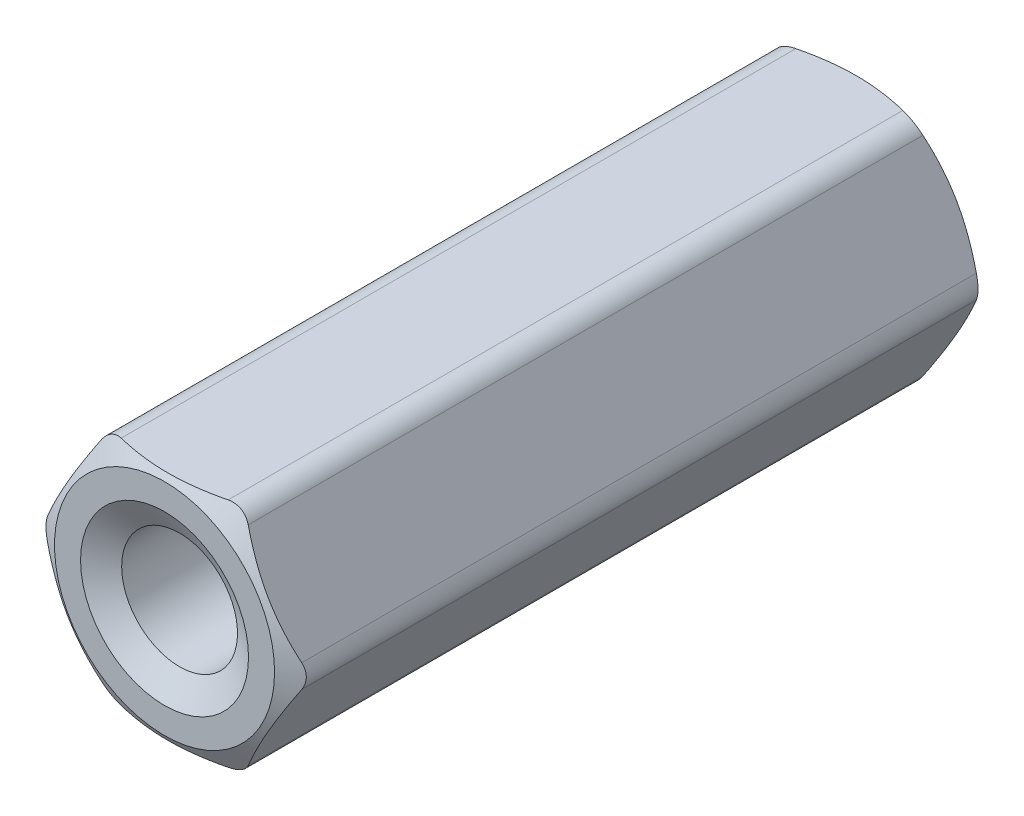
ISO-10303-21;
HEADER;
FILE_DESCRIPTION(('STEP AP214'),'2;1');
FILE_NAME('part.step','',(''),(''),'','','');
FILE_SCHEMA(('AUTOMOTIVE_DESIGN { 1 0 10303 214 1 1 1 1 }'));
ENDSEC;
DATA;
#1=APPLICATION_CONTEXT('core data for automotive mechanical design processes');
#2=APPLICATION_PROTOCOL_DEFINITION('international standard','automotive_design',2000,#1);
#3=PRODUCT_CONTEXT('',#1,'mechanical');
#4=PRODUCT('Part','Part','',(#3));
#5=PRODUCT_RELATED_PRODUCT_CATEGORY('part','',(#4));
#6=PRODUCT_DEFINITION_FORMATION('','',#4);
#7=PRODUCT_DEFINITION_CONTEXT('part definition',#1,'design');
#8=PRODUCT_DEFINITION('design','',#6,#7);
#9=PRODUCT_DEFINITION_SHAPE('','',#8);
#10=(LENGTH_UNIT() NAMED_UNIT(*) SI_UNIT(.MILLI.,.METRE.));
#11=(NAMED_UNIT(*) PLANE_ANGLE_UNIT() SI_UNIT($,.RADIAN.));
#12=(NAMED_UNIT(*) SI_UNIT($,.STERADIAN.) SOLID_ANGLE_UNIT());
#13=UNCERTAINTY_MEASURE_WITH_UNIT(LENGTH_MEASURE(1.E-05),#10,'distance_accuracy_value','');
#14=(GEOMETRIC_REPRESENTATION_CONTEXT(3) GLOBAL_UNCERTAINTY_ASSIGNED_CONTEXT((#13)) GLOBAL_UNIT_ASSIGNED_CONTEXT((#10,
#11,#12)) REPRESENTATION_CONTEXT('',''));
#15=CARTESIAN_POINT('',(0.,0.,0.));
#16=DIRECTION('',(0.,0.,1.));
#17=DIRECTION('',(1.,0.,0.));
#18=AXIS2_PLACEMENT_3D('',#15,#16,#17);
#19=CARTESIAN_POINT('',(2.30940107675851,4.00000000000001,-12.));
#20=DIRECTION('',(0.,1.,0.));
#21=DIRECTION('',(0.,0.,1.));
#22=AXIS2_PLACEMENT_3D('',#19,#20,#21);
#23=PLANE('',#22);
#24=CARTESIAN_POINT('',(-22.6775595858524,4.00000000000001,0.89892307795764));
#25=CARTESIAN_POINT('',(-21.9687900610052,4.00000000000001,1.30187733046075));
#26=CARTESIAN_POINT('',(-21.2598018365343,4.00000000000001,1.70444847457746));
#27=CARTESIAN_POINT('',(-19.8403455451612,4.00000000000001,2.50889452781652));
#28=CARTESIAN_POINT('',(-19.1298767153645,4.00000000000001,2.91076809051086));
#29=CARTESIAN_POINT('',(-17.6915314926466,4.00000000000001,3.72227766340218));
#30=CARTESIAN_POINT('',(-16.9636343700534,4.00000000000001,4.13187695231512));
#31=CARTESIAN_POINT('',(-15.5073665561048,4.00000000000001,4.9482500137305));
#32=CARTESIAN_POINT('',(-14.7789973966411,4.00000000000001,5.35502651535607));
#33=CARTESIAN_POINT('',(-13.5486891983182,4.00000000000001,6.03819119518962));
#34=CARTESIAN_POINT('',(-13.047272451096,4.00000000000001,6.3155192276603));
#35=CARTESIAN_POINT('',(-12.0431611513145,4.00000000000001,6.86784942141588));
#36=CARTESIAN_POINT('',(-11.5404666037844,4.00000000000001,7.14285159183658));
#37=CARTESIAN_POINT('',(-10.5312123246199,4.00000000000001,7.69068754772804));
#38=CARTESIAN_POINT('',(-10.0246451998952,4.00000000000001,7.96350775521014));
#39=CARTESIAN_POINT('',(-9.26289103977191,4.00000000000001,8.36893899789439));
#40=CARTESIAN_POINT('',(-9.00870246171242,4.00000000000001,8.50342528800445));
#41=CARTESIAN_POINT('',(-8.49949961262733,4.00000000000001,8.77082438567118));
#42=CARTESIAN_POINT('',(-8.24448534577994,4.00000000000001,8.90373720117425));
#43=CARTESIAN_POINT('',(-7.73797592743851,4.00000000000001,9.16522528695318));
#44=CARTESIAN_POINT('',(-7.48649892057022,4.00000000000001,9.29383565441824));
#45=CARTESIAN_POINT('',(-6.98229104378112,4.00000000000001,9.54859322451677));
#46=CARTESIAN_POINT('',(-6.72956014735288,4.00000000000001,9.67474037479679));
#47=CARTESIAN_POINT('',(-6.22211865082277,4.00000000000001,9.92399991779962));
#48=CARTESIAN_POINT('',(-5.96740560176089,4.00000000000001,10.0471073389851));
#49=CARTESIAN_POINT('',(-5.45593950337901,4.00000000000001,10.288988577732));
#50=CARTESIAN_POINT('',(-5.19918657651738,4.00000000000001,10.4077626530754));
#51=CARTESIAN_POINT('',(-4.68496908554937,4.00000000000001,10.6385161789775));
#52=CARTESIAN_POINT('',(-4.42752470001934,4.00000000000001,10.7505403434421));
#53=CARTESIAN_POINT('',(-3.90913083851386,4.00000000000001,10.966494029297));
#54=CARTESIAN_POINT('',(-3.6481802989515,4.00000000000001,11.0704210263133));
#55=CARTESIAN_POINT('',(-3.12263805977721,4.00000000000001,11.2664361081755));
#56=CARTESIAN_POINT('',(-2.8580582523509,4.00000000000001,11.3585557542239));
#57=CARTESIAN_POINT('',(-2.32375162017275,4.00000000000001,11.5262418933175));
#58=CARTESIAN_POINT('',(-2.05402940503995,4.00000000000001,11.6018225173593));
#59=CARTESIAN_POINT('',(-1.73277534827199,4.00000000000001,11.6772847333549));
#60=CARTESIAN_POINT('',(-1.68383875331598,4.00000000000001,11.688386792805));
#61=CARTESIAN_POINT('',(-1.58578740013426,4.00000000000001,11.7098040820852));
#62=CARTESIAN_POINT('',(-1.53667262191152,4.00000000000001,11.7201192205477));
#63=CARTESIAN_POINT('',(-1.38904785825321,4.00000000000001,11.7498260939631));
#64=CARTESIAN_POINT('',(-1.29028345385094,4.00000000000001,11.7679731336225));
#65=CARTESIAN_POINT('',(-1.09219971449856,4.00000000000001,11.8006142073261));
#66=CARTESIAN_POINT('',(-0.992880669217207,4.00000000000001,11.815109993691));
#67=CARTESIAN_POINT('',(-0.793749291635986,4.00000000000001,11.8401683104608));
#68=CARTESIAN_POINT('',(-0.693936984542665,4.00000000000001,11.8507310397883));
#69=CARTESIAN_POINT('',(-0.496110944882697,4.00000000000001,11.8675054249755));
#70=CARTESIAN_POINT('',(-0.39810483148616,4.00000000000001,11.8738059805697));
#71=CARTESIAN_POINT('',(-0.201922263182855,4.00000000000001,11.8822805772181));
#72=CARTESIAN_POINT('',(-0.103745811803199,4.00000000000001,11.8844547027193));
#73=CARTESIAN_POINT('',(0.190902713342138,4.00000000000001,11.8846738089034));
#74=CARTESIAN_POINT('',(0.38742185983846,4.00000000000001,11.8764092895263));
#75=CARTESIAN_POINT('',(0.721434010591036,4.00000000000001,11.8486062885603));
#76=CARTESIAN_POINT('',(0.859290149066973,4.00000000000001,11.8330979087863));
#77=CARTESIAN_POINT('',(1.13398945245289,4.00000000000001,11.7947514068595));
#78=CARTESIAN_POINT('',(1.27083248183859,4.00000000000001,11.7719123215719));
#79=CARTESIAN_POINT('',(1.67955338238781,4.00000000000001,11.6936126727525));
#80=CARTESIAN_POINT('',(1.94957735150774,4.00000000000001,11.6283740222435));
#81=CARTESIAN_POINT('',(2.35412325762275,4.00000000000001,11.5151591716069));
#82=CARTESIAN_POINT('',(2.49072635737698,4.00000000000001,11.4742004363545));
#83=CARTESIAN_POINT('',(2.76260114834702,4.00000000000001,11.3880409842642));
#84=CARTESIAN_POINT('',(2.89787282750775,4.00000000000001,11.3428402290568));
#85=CARTESIAN_POINT('',(3.16715539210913,4.00000000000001,11.248914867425));
#86=CARTESIAN_POINT('',(3.30116644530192,4.00000000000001,11.200190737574));
#87=CARTESIAN_POINT('',(3.56807302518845,4.00000000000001,11.099802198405));
#88=CARTESIAN_POINT('',(3.70096859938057,4.00000000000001,11.0481379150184));
#89=CARTESIAN_POINT('',(3.99088962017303,4.00000000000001,10.9323234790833));
#90=CARTESIAN_POINT('',(4.1477109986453,4.00000000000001,10.8676637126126));
#91=CARTESIAN_POINT('',(4.46016288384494,4.00000000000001,10.7355221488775));
#92=CARTESIAN_POINT('',(4.6157933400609,4.00000000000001,10.6680402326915));
#93=CARTESIAN_POINT('',(5.08121549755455,4.00000000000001,10.4621401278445));
#94=CARTESIAN_POINT('',(5.38948713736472,4.00000000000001,10.320288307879));
#95=CARTESIAN_POINT('',(6.00327195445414,4.00000000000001,10.0302657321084));
#96=CARTESIAN_POINT('',(6.30878310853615,4.00000000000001,9.88209073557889));
#97=CARTESIAN_POINT('',(6.91758740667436,4.00000000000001,9.5813315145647));
#98=CARTESIAN_POINT('',(7.22088074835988,4.00000000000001,9.42874768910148));
#99=CARTESIAN_POINT('',(7.82649922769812,4.00000000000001,9.12001473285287));
#100=CARTESIAN_POINT('',(8.1288206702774,4.00000000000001,8.96385837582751));
#101=CARTESIAN_POINT('',(8.73220518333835,4.00000000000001,8.64912249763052));
#102=CARTESIAN_POINT('',(9.03326822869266,4.00000000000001,8.49054292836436));
#103=CARTESIAN_POINT('',(9.63429237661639,4.00000000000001,8.17159499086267));
#104=CARTESIAN_POINT('',(9.93425386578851,4.00000000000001,8.01122735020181));
#105=CARTESIAN_POINT('',(10.5333989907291,4.00000000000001,7.68904478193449));
#106=CARTESIAN_POINT('',(10.8325826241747,4.00000000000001,7.52722985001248));
#107=CARTESIAN_POINT('',(11.6385962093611,4.00000000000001,7.08929966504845));
#108=CARTESIAN_POINT('',(12.1448425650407,4.00000000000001,6.81211069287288));
#109=CARTESIAN_POINT('',(13.1561267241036,4.00000000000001,6.25540489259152));
#110=CARTESIAN_POINT('',(13.6611643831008,4.00000000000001,5.97588780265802));
#111=CARTESIAN_POINT('',(14.6682561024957,4.00000000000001,5.41632709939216));
#112=CARTESIAN_POINT('',(15.1703139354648,4.00000000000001,5.13629027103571));
#113=CARTESIAN_POINT('',(16.1736591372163,4.00000000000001,4.57498529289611));
#114=CARTESIAN_POINT('',(16.6749465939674,4.00000000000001,4.29371730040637));
#115=CARTESIAN_POINT('',(17.1759861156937,4.00000000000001,4.01201078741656));
#116=B_SPLINE_CURVE_WITH_KNOTS('',3,(#24,#25,#26,#27,#28,#29,#30,#31,#32,#33,#34,#35,#36,#37,
#38,#39,#40,#41,#42,#43,#44,#45,#46,#47,#48,#49,#50,#51,#52,#53,#54,#55,#56,#57,#58,#59,#60,#61,
#62,#63,#64,#65,#66,#67,#68,#69,#70,#71,#72,#73,#74,#75,#76,#77,#78,#79,#80,#81,#82,#83,#84,#85,
#86,#87,#88,#89,#90,#91,#92,#93,#94,#95,#96,#97,#98,#99,#100,#101,#102,#103,#104,#105,#106,#107,
#108,#109,#110,#111,#112,#113,#114,#115),.UNSPECIFIED.,.F.,.F.,(4,2,2,2,2,2,2,2,2,2,2,2,2,2,2,2,
2,2,2,2,2,2,2,2,2,2,2,2,2,2,2,2,2,2,2,2,2,2,2,2,2,2,2,2,2,4),(0.,2.44592366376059,
4.89468023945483,7.40036153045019,9.90313264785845,11.6221296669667,13.3411199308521,
15.0671832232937,15.9298989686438,16.7926103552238,17.6399676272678,18.4873428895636,
19.3360228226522,20.1846521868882,21.026842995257,21.8692953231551,22.7094465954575,
23.5488772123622,23.6994129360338,23.8499661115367,24.1511526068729,24.45219427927,
24.7532207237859,25.0477569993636,25.3422872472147,25.9315641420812,26.3475496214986,
26.7635897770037,27.5958072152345,28.0236047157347,28.4514060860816,28.8791496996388,
29.3068750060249,29.8157253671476,30.3245971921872,31.3425055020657,32.3611075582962,
33.379617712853,34.4004112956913,35.4212251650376,36.4416378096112,37.4620534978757,
39.1935379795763,40.9252198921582,42.6498465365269,44.3742589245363),.UNSPECIFIED.);
#117=CARTESIAN_POINT('',(-1.84752086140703,4.00000000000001,11.6500931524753));
#118=VERTEX_POINT('',#117);
#119=CARTESIAN_POINT('',(1.84752086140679,4.00000000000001,11.6500931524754));
#120=VERTEX_POINT('',#119);
#121=EDGE_CURVE('E235',#118,#120,#116,.T.);
#122=ORIENTED_EDGE('',*,*,#121,.T.);
#123=DIRECTION('',(0.,0.,1.));
#124=VECTOR('',#123,1.);
#125=CARTESIAN_POINT('',(1.84752086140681,4.00000000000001,-12.));
#126=LINE('',#125,#124);
#127=CARTESIAN_POINT('',(1.84752086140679,4.00000000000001,-11.6500931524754));
#128=VERTEX_POINT('',#127);
#129=EDGE_CURVE('E177',#120,#128,#126,.F.);
#130=ORIENTED_EDGE('',*,*,#129,.T.);
#131=CARTESIAN_POINT('',(-22.6775595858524,4.00000000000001,-0.898923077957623));
#132=CARTESIAN_POINT('',(-21.9687900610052,4.00000000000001,-1.30187733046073));
#133=CARTESIAN_POINT('',(-21.2598018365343,4.00000000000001,-1.70444847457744));
#134=CARTESIAN_POINT('',(-19.8403455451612,4.00000000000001,-2.5088945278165));
#135=CARTESIAN_POINT('',(-19.1298767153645,4.00000000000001,-2.91076809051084));
#136=CARTESIAN_POINT('',(-17.6915314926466,4.00000000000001,-3.72227766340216));
#137=CARTESIAN_POINT('',(-16.9636343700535,4.00000000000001,-4.13187695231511));
#138=CARTESIAN_POINT('',(-15.5073665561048,4.00000000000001,-4.94825001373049));
#139=CARTESIAN_POINT('',(-14.7789973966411,4.00000000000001,-5.35502651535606));
#140=CARTESIAN_POINT('',(-13.5486891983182,4.00000000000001,-6.0381911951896));
#141=CARTESIAN_POINT('',(-13.047272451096,4.00000000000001,-6.31551922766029));
#142=CARTESIAN_POINT('',(-12.0431611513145,4.00000000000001,-6.86784942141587));
#143=CARTESIAN_POINT('',(-11.5404666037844,4.00000000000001,-7.14285159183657));
#144=CARTESIAN_POINT('',(-10.5312123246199,4.00000000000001,-7.69068754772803));
#145=CARTESIAN_POINT('',(-10.0246451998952,4.00000000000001,-7.96350775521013));
#146=CARTESIAN_POINT('',(-9.26289103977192,4.00000000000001,-8.36893899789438));
#147=CARTESIAN_POINT('',(-9.00870246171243,4.00000000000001,-8.50342528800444));
#148=CARTESIAN_POINT('',(-8.49949961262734,4.00000000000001,-8.77082438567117));
#149=CARTESIAN_POINT('',(-8.24448534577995,4.00000000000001,-8.90373720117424));
#150=CARTESIAN_POINT('',(-7.73797592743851,4.00000000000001,-9.16522528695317));
#151=CARTESIAN_POINT('',(-7.48649892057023,4.00000000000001,-9.29383565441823));
#152=CARTESIAN_POINT('',(-6.98229104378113,4.00000000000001,-9.54859322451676));
#153=CARTESIAN_POINT('',(-6.72956014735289,4.00000000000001,-9.67474037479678));
#154=CARTESIAN_POINT('',(-6.22211865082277,4.00000000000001,-9.92399991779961));
#155=CARTESIAN_POINT('',(-5.96740560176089,4.00000000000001,-10.0471073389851));
#156=CARTESIAN_POINT('',(-5.45593950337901,4.00000000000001,-10.288988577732));
#157=CARTESIAN_POINT('',(-5.19918657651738,4.00000000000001,-10.4077626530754));
#158=CARTESIAN_POINT('',(-4.68496908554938,4.00000000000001,-10.6385161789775));
#159=CARTESIAN_POINT('',(-4.42752470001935,4.00000000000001,-10.7505403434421));
#160=CARTESIAN_POINT('',(-3.90913083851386,4.00000000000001,-10.966494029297));
#161=CARTESIAN_POINT('',(-3.6481802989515,4.00000000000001,-11.0704210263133));
#162=CARTESIAN_POINT('',(-3.12263805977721,4.00000000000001,-11.2664361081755));
#163=CARTESIAN_POINT('',(-2.8580582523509,4.00000000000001,-11.3585557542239));
#164=CARTESIAN_POINT('',(-2.32375162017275,4.00000000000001,-11.5262418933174));
#165=CARTESIAN_POINT('',(-2.05402940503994,4.00000000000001,-11.6018225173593));
#166=CARTESIAN_POINT('',(-1.73277534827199,4.00000000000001,-11.6772847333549));
#167=CARTESIAN_POINT('',(-1.68383875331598,4.00000000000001,-11.688386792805));
#168=CARTESIAN_POINT('',(-1.58578740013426,4.00000000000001,-11.7098040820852));
#169=CARTESIAN_POINT('',(-1.53667262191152,4.00000000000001,-11.7201192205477));
#170=CARTESIAN_POINT('',(-1.38904785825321,4.00000000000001,-11.7498260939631));
#171=CARTESIAN_POINT('',(-1.29028345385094,4.00000000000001,-11.7679731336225));
#172=CARTESIAN_POINT('',(-1.09219971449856,4.00000000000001,-11.8006142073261));
#173=CARTESIAN_POINT('',(-0.992880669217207,4.00000000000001,-11.815109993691));
#174=CARTESIAN_POINT('',(-0.793749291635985,4.00000000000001,-11.8401683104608));
#175=CARTESIAN_POINT('',(-0.693936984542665,4.00000000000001,-11.8507310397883));
#176=CARTESIAN_POINT('',(-0.496110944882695,4.00000000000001,-11.8675054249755));
#177=CARTESIAN_POINT('',(-0.398104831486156,4.00000000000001,-11.8738059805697));
#178=CARTESIAN_POINT('',(-0.20192226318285,4.00000000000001,-11.8822805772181));
#179=CARTESIAN_POINT('',(-0.103745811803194,4.00000000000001,-11.8844547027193));
#180=CARTESIAN_POINT('',(0.190902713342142,4.00000000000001,-11.8846738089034));
#181=CARTESIAN_POINT('',(0.387421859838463,4.00000000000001,-11.8764092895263));
#182=CARTESIAN_POINT('',(0.721434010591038,4.00000000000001,-11.8486062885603));
#183=CARTESIAN_POINT('',(0.859290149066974,4.00000000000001,-11.8330979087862));
#184=CARTESIAN_POINT('',(1.13398945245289,4.00000000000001,-11.7947514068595));
#185=CARTESIAN_POINT('',(1.27083248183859,4.00000000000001,-11.7719123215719));
#186=CARTESIAN_POINT('',(1.67955338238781,4.00000000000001,-11.6936126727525));
#187=CARTESIAN_POINT('',(1.94957735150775,4.00000000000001,-11.6283740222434));
#188=CARTESIAN_POINT('',(2.35412325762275,4.00000000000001,-11.5151591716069));
#189=CARTESIAN_POINT('',(2.49072635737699,4.00000000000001,-11.4742004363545));
#190=CARTESIAN_POINT('',(2.76260114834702,4.00000000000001,-11.3880409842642));
#191=CARTESIAN_POINT('',(2.89787282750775,4.00000000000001,-11.3428402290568));
#192=CARTESIAN_POINT('',(3.16715539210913,4.00000000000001,-11.248914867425));
#193=CARTESIAN_POINT('',(3.30116644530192,4.00000000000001,-11.200190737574));
#194=CARTESIAN_POINT('',(3.56807302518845,4.00000000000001,-11.099802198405));
#195=CARTESIAN_POINT('',(3.70096859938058,4.00000000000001,-11.0481379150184));
#196=CARTESIAN_POINT('',(3.99088962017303,4.00000000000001,-10.9323234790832));
#197=CARTESIAN_POINT('',(4.14771099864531,4.00000000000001,-10.8676637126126));
#198=CARTESIAN_POINT('',(4.46016288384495,4.00000000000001,-10.7355221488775));
#199=CARTESIAN_POINT('',(4.6157933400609,4.00000000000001,-10.6680402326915));
#200=CARTESIAN_POINT('',(5.08121549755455,4.00000000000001,-10.4621401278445));
#201=CARTESIAN_POINT('',(5.38948713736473,4.00000000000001,-10.320288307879));
#202=CARTESIAN_POINT('',(6.00327195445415,4.00000000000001,-10.0302657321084));
#203=CARTESIAN_POINT('',(6.30878310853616,4.00000000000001,-9.88209073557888));
#204=CARTESIAN_POINT('',(6.91758740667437,4.00000000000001,-9.58133151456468));
#205=CARTESIAN_POINT('',(7.2208807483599,4.00000000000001,-9.42874768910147));
#206=CARTESIAN_POINT('',(7.82649922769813,4.00000000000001,-9.12001473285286));
#207=CARTESIAN_POINT('',(8.12882067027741,4.00000000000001,-8.9638583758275));
#208=CARTESIAN_POINT('',(8.73220518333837,4.00000000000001,-8.6491224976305));
#209=CARTESIAN_POINT('',(9.03326822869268,4.00000000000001,-8.49054292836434));
#210=CARTESIAN_POINT('',(9.63429237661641,4.00000000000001,-8.17159499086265));
#211=CARTESIAN_POINT('',(9.93425386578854,4.00000000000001,-8.01122735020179));
#212=CARTESIAN_POINT('',(10.5333989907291,4.00000000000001,-7.68904478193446));
#213=CARTESIAN_POINT('',(10.8325826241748,4.00000000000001,-7.52722985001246));
#214=CARTESIAN_POINT('',(11.6385962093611,4.00000000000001,-7.08929966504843));
#215=CARTESIAN_POINT('',(12.1448425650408,4.00000000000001,-6.81211069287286));
#216=CARTESIAN_POINT('',(13.1561267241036,4.00000000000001,-6.25540489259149));
#217=CARTESIAN_POINT('',(13.6611643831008,4.00000000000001,-5.975887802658));
#218=CARTESIAN_POINT('',(14.6682561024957,4.00000000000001,-5.41632709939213));
#219=CARTESIAN_POINT('',(15.1703139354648,4.00000000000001,-5.13629027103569));
#220=CARTESIAN_POINT('',(16.1736591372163,4.00000000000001,-4.57498529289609));
#221=CARTESIAN_POINT('',(16.6749465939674,4.00000000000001,-4.29371730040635));
#222=CARTESIAN_POINT('',(17.1759861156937,4.00000000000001,-4.01201078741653));
#223=B_SPLINE_CURVE_WITH_KNOTS('',3,(#131,#132,#133,#134,#135,#136,#137,#138,#139,#140,#141,
#142,#143,#144,#145,#146,#147,#148,#149,#150,#151,#152,#153,#154,#155,#156,#157,#158,#159,#160,
#161,#162,#163,#164,#165,#166,#167,#168,#169,#170,#171,#172,#173,#174,#175,#176,#177,#178,#179,
#180,#181,#182,#183,#184,#185,#186,#187,#188,#189,#190,#191,#192,#193,#194,#195,#196,#197,#198,
#199,#200,#201,#202,#203,#204,#205,#206,#207,#208,#209,#210,#211,#212,#213,#214,#215,#216,#217,
#218,#219,#220,#221,#222),.UNSPECIFIED.,.F.,.F.,(4,2,2,2,2,2,2,2,2,2,2,2,2,2,2,2,2,2,2,2,2,2,2,
2,2,2,2,2,2,2,2,2,2,2,2,2,2,2,2,2,2,2,2,2,2,4),(0.,2.44592366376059,4.89468023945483,
7.4003615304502,9.90313264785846,11.6221296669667,13.3411199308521,15.0671832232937,
15.9298989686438,16.7926103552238,17.6399676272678,18.4873428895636,19.3360228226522,
20.1846521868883,21.026842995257,21.8692953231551,22.7094465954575,23.5488772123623,
23.6994129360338,23.8499661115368,24.1511526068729,24.4521942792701,24.7532207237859,
25.0477569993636,25.3422872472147,25.9315641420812,26.3475496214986,26.7635897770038,
27.5958072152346,28.0236047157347,28.4514060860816,28.8791496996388,29.3068750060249,
29.8157253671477,30.3245971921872,31.3425055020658,32.3611075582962,33.379617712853,
34.4004112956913,35.4212251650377,36.4416378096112,37.4620534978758,39.1935379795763,
40.9252198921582,42.649846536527,44.3742589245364),.UNSPECIFIED.);
#224=CARTESIAN_POINT('',(-1.84752086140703,4.00000000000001,-11.6500931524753));
#225=VERTEX_POINT('',#224);
#226=EDGE_CURVE('E163',#128,#225,#223,.F.);
#227=ORIENTED_EDGE('',*,*,#226,.T.);
#228=DIRECTION('',(0.,0.,1.));
#229=VECTOR('',#228,1.);
#230=CARTESIAN_POINT('',(-1.84752086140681,4.00000000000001,-12.));
#231=LINE('',#230,#229);
#232=EDGE_CURVE('E437',#225,#118,#231,.T.);
#233=ORIENTED_EDGE('',*,*,#232,.T.);
#234=EDGE_LOOP('',(#122,#130,#227,#233));
#235=FACE_BOUND('',#234,.T.);
#236=ADVANCED_FACE('F47',(#235),#23,.T.);
#237=CARTESIAN_POINT('',(4.61880215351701,0.,-12.));
#238=DIRECTION('',(0.866025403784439,0.5,0.));
#239=DIRECTION('',(-0.5,0.866025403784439,0.));
#240=AXIS2_PLACEMENT_3D('',#237,#238,#239);
#241=PLANE('',#240);
#242=CARTESIAN_POINT('',(4.61891762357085,-0.000199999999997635,-11.5271976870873));
#243=CARTESIAN_POINT('',(4.51743148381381,0.175579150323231,-11.5858120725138));
#244=CARTESIAN_POINT('',(4.41506932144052,0.352875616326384,-11.6391196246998));
#245=CARTESIAN_POINT('',(4.2085725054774,0.71053859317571,-11.7321682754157));
#246=CARTESIAN_POINT('',(4.10443418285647,0.890911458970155,-11.7718764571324));
#247=CARTESIAN_POINT('',(3.89744813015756,1.24942181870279,-11.8336877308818));
#248=CARTESIAN_POINT('',(3.7946322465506,1.42750415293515,-11.8562022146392));
#249=CARTESIAN_POINT('',(3.58851671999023,1.78450671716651,-11.8830793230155));
#250=CARTESIAN_POINT('',(3.48521782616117,1.96342564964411,-11.8874642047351));
#251=CARTESIAN_POINT('',(3.29219970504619,2.29774284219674,-11.8783398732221));
#252=CARTESIAN_POINT('',(3.20245157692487,2.45319115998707,-11.8670709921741));
#253=CARTESIAN_POINT('',(3.02354002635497,2.76307505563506,-11.8313559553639));
#254=CARTESIAN_POINT('',(2.93437722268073,2.91750956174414,-11.8068976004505));
#255=CARTESIAN_POINT('',(2.75509682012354,3.22803232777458,-11.7457538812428));
#256=CARTESIAN_POINT('',(2.6650019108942,3.38408128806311,-11.7088093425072));
#257=CARTESIAN_POINT('',(2.48615580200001,3.69385183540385,-11.624959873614));
#258=CARTESIAN_POINT('',(2.39740231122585,3.84757739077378,-11.5780746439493));
#259=CARTESIAN_POINT('',(2.30928560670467,4.00020000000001,-11.5271976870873));
#260=B_SPLINE_CURVE_WITH_KNOTS('',3,(#242,#243,#244,#245,#246,#247,#248,#249,#250,#251,#252,
#253,#254,#255,#256,#257,#258,#259),.UNSPECIFIED.,.F.,.F.,(4,2,2,2,2,2,2,2,4),(0.,
0.634047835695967,1.26961969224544,1.88946157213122,2.50854226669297,3.04757825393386,
3.58711366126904,4.13861653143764,4.68903648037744),.UNSPECIFIED.);
#261=CARTESIAN_POINT('',(4.38786204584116,0.400000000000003,-11.6500931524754));
#262=VERTEX_POINT('',#261);
#263=CARTESIAN_POINT('',(2.54034118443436,3.60000000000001,-11.6500931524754));
#264=VERTEX_POINT('',#263);
#265=EDGE_CURVE('E144',#262,#264,#260,.T.);
#266=ORIENTED_EDGE('',*,*,#265,.T.);
#267=DIRECTION('',(0.,0.,1.));
#268=VECTOR('',#267,1.);
#269=CARTESIAN_POINT('',(2.54034118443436,3.60000000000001,-12.));
#270=LINE('',#269,#268);
#271=CARTESIAN_POINT('',(2.54034118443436,3.60000000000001,11.6500931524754));
#272=VERTEX_POINT('',#271);
#273=EDGE_CURVE('E151',#264,#272,#270,.T.);
#274=ORIENTED_EDGE('',*,*,#273,.T.);
#275=CARTESIAN_POINT('',(2.30928560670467,4.00020000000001,11.5271976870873));
#276=CARTESIAN_POINT('',(2.41077174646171,3.82442084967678,11.5858120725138));
#277=CARTESIAN_POINT('',(2.513133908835,3.64712438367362,11.6391196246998));
#278=CARTESIAN_POINT('',(2.71963072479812,3.2894614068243,11.7321682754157));
#279=CARTESIAN_POINT('',(2.82376904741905,3.10908854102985,11.7718764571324));
#280=CARTESIAN_POINT('',(3.03075510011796,2.75057818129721,11.8336877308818));
#281=CARTESIAN_POINT('',(3.13357098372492,2.57249584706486,11.8562022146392));
#282=CARTESIAN_POINT('',(3.33968651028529,2.21549328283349,11.8830793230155));
#283=CARTESIAN_POINT('',(3.44298540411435,2.0365743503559,11.8874642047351));
#284=CARTESIAN_POINT('',(3.63600352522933,1.70225715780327,11.8783398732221));
#285=CARTESIAN_POINT('',(3.72575165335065,1.54680884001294,11.8670709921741));
#286=CARTESIAN_POINT('',(3.90466320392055,1.23692494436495,11.8313559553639));
#287=CARTESIAN_POINT('',(3.99382600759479,1.08249043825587,11.8068976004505));
#288=CARTESIAN_POINT('',(4.17310641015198,0.771967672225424,11.7457538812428));
#289=CARTESIAN_POINT('',(4.26320131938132,0.6159187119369,11.7088093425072));
#290=CARTESIAN_POINT('',(4.44204742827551,0.306148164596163,11.624959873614));
#291=CARTESIAN_POINT('',(4.53080091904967,0.152422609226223,11.5780746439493));
#292=CARTESIAN_POINT('',(4.61891762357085,-0.000199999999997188,11.5271976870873));
#293=B_SPLINE_CURVE_WITH_KNOTS('',3,(#275,#276,#277,#278,#279,#280,#281,#282,#283,#284,#285,
#286,#287,#288,#289,#290,#291,#292),.UNSPECIFIED.,.F.,.F.,(4,2,2,2,2,2,2,2,4),(0.,
0.634047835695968,1.26961969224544,1.88946157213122,2.50854226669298,3.04757825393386,
3.58711366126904,4.13861653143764,4.68903648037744),.UNSPECIFIED.);
#294=CARTESIAN_POINT('',(4.38786204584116,0.400000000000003,11.6500931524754));
#295=VERTEX_POINT('',#294);
#296=EDGE_CURVE('E147',#272,#295,#293,.T.);
#297=ORIENTED_EDGE('',*,*,#296,.T.);
#298=DIRECTION('',(0.,0.,1.));
#299=VECTOR('',#298,1.);
#300=CARTESIAN_POINT('',(4.38786204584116,0.400000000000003,-12.));
#301=LINE('',#300,#299);
#302=EDGE_CURVE('E140',#295,#262,#301,.F.);
#303=ORIENTED_EDGE('',*,*,#302,.T.);
#304=EDGE_LOOP('',(#266,#274,#297,#303));
#305=FACE_BOUND('',#304,.T.);
#306=ADVANCED_FACE('F142',(#305),#241,.T.);
#307=CARTESIAN_POINT('',(2.30940107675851,-4.,-12.));
#308=DIRECTION('',(0.866025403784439,-0.5,0.));
#309=DIRECTION('',(0.5,0.866025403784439,0.));
#310=AXIS2_PLACEMENT_3D('',#307,#308,#309);
#311=PLANE('',#310);
#312=CARTESIAN_POINT('',(4.61891762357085,0.000200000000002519,11.5271976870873));
#313=CARTESIAN_POINT('',(4.51743148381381,-0.175579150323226,11.5858120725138));
#314=CARTESIAN_POINT('',(4.41506932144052,-0.352875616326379,11.6391196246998));
#315=CARTESIAN_POINT('',(4.2085725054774,-0.710538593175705,11.7321682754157));
#316=CARTESIAN_POINT('',(4.10443418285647,-0.890911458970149,11.7718764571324));
#317=CARTESIAN_POINT('',(3.89744813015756,-1.24942181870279,11.8336877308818));
#318=CARTESIAN_POINT('',(3.7946322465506,-1.42750415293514,11.8562022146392));
#319=CARTESIAN_POINT('',(3.58851671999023,-1.78450671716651,11.8830793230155));
#320=CARTESIAN_POINT('',(3.48521782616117,-1.9634256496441,11.8874642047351));
#321=CARTESIAN_POINT('',(3.29219970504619,-2.29774284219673,11.8783398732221));
#322=CARTESIAN_POINT('',(3.20245157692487,-2.45319115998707,11.8670709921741));
#323=CARTESIAN_POINT('',(3.02354002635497,-2.76307505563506,11.8313559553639));
#324=CARTESIAN_POINT('',(2.93437722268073,-2.91750956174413,11.8068976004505));
#325=CARTESIAN_POINT('',(2.75509682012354,-3.22803232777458,11.7457538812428));
#326=CARTESIAN_POINT('',(2.6650019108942,-3.3840812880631,11.7088093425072));
#327=CARTESIAN_POINT('',(2.48615580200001,-3.69385183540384,11.624959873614));
#328=CARTESIAN_POINT('',(2.39740231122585,-3.84757739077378,11.5780746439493));
#329=CARTESIAN_POINT('',(2.30928560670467,-4.0002,11.5271976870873));
#330=B_SPLINE_CURVE_WITH_KNOTS('',3,(#312,#313,#314,#315,#316,#317,#318,#319,#320,#321,#322,
#323,#324,#325,#326,#327,#328,#329),.UNSPECIFIED.,.F.,.F.,(4,2,2,2,2,2,2,2,4),(0.,
0.634047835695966,1.26961969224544,1.88946157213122,2.50854226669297,3.04757825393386,
3.58711366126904,4.13861653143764,4.68903648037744),.UNSPECIFIED.);
#331=CARTESIAN_POINT('',(4.38786204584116,-0.399999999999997,11.6500931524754));
#332=VERTEX_POINT('',#331);
#333=CARTESIAN_POINT('',(2.54034118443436,-3.6,11.6500931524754));
#334=VERTEX_POINT('',#333);
#335=EDGE_CURVE('E272',#332,#334,#330,.T.);
#336=ORIENTED_EDGE('',*,*,#335,.T.);
#337=DIRECTION('',(0.,0.,1.));
#338=VECTOR('',#337,1.);
#339=CARTESIAN_POINT('',(2.54034118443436,-3.6,-12.));
#340=LINE('',#339,#338);
#341=CARTESIAN_POINT('',(2.54034118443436,-3.6,-11.6500931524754));
#342=VERTEX_POINT('',#341);
#343=EDGE_CURVE('E12',#334,#342,#340,.F.);
#344=ORIENTED_EDGE('',*,*,#343,.T.);
#345=CARTESIAN_POINT('',(2.30928560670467,-4.0002,-11.5271976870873));
#346=CARTESIAN_POINT('',(2.41077174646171,-3.82442084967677,-11.5858120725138));
#347=CARTESIAN_POINT('',(2.513133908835,-3.64712438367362,-11.6391196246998));
#348=CARTESIAN_POINT('',(2.71963072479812,-3.28946140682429,-11.7321682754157));
#349=CARTESIAN_POINT('',(2.82376904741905,-3.10908854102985,-11.7718764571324));
#350=CARTESIAN_POINT('',(3.03075510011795,-2.75057818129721,-11.8336877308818));
#351=CARTESIAN_POINT('',(3.13357098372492,-2.57249584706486,-11.8562022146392));
#352=CARTESIAN_POINT('',(3.33968651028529,-2.21549328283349,-11.8830793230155));
#353=CARTESIAN_POINT('',(3.44298540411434,-2.0365743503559,-11.8874642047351));
#354=CARTESIAN_POINT('',(3.63600352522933,-1.70225715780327,-11.8783398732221));
#355=CARTESIAN_POINT('',(3.72575165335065,-1.54680884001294,-11.8670709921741));
#356=CARTESIAN_POINT('',(3.90466320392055,-1.23692494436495,-11.8313559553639));
#357=CARTESIAN_POINT('',(3.99382600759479,-1.08249043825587,-11.8068976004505));
#358=CARTESIAN_POINT('',(4.17310641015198,-0.771967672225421,-11.7457538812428));
#359=CARTESIAN_POINT('',(4.26320131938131,-0.615918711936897,-11.7088093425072));
#360=CARTESIAN_POINT('',(4.44204742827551,-0.306148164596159,-11.624959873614));
#361=CARTESIAN_POINT('',(4.53080091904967,-0.152422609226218,-11.5780746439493));
#362=CARTESIAN_POINT('',(4.61891762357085,0.000200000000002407,-11.5271976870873));
#363=B_SPLINE_CURVE_WITH_KNOTS('',3,(#345,#346,#347,#348,#349,#350,#351,#352,#353,#354,#355,
#356,#357,#358,#359,#360,#361,#362),.UNSPECIFIED.,.F.,.F.,(4,2,2,2,2,2,2,2,4),(0.,
0.634047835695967,1.26961969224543,1.88946157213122,2.50854226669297,3.04757825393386,
3.58711366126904,4.13861653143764,4.68903648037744),.UNSPECIFIED.);
#364=CARTESIAN_POINT('',(4.38786204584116,-0.399999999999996,-11.6500931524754));
#365=VERTEX_POINT('',#364);
#366=EDGE_CURVE('E164',#342,#365,#363,.T.);
#367=ORIENTED_EDGE('',*,*,#366,.T.);
#368=DIRECTION('',(0.,0.,1.));
#369=VECTOR('',#368,1.);
#370=CARTESIAN_POINT('',(4.38786204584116,-0.399999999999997,-12.));
#371=LINE('',#370,#369);
#372=EDGE_CURVE('E57',#365,#332,#371,.T.);
#373=ORIENTED_EDGE('',*,*,#372,.T.);
#374=EDGE_LOOP('',(#336,#344,#367,#373));
#375=FACE_BOUND('',#374,.T.);
#376=ADVANCED_FACE('F355',(#375),#311,.T.);
#377=CARTESIAN_POINT('',(-2.30940107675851,-4.,-12.));
#378=DIRECTION('',(0.,-1.,0.));
#379=DIRECTION('',(0.,0.,-1.));
#380=AXIS2_PLACEMENT_3D('',#377,#378,#379);
#381=PLANE('',#380);
#382=CARTESIAN_POINT('',(-22.6775595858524,-4.,0.898923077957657));
#383=CARTESIAN_POINT('',(-21.9687900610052,-4.,1.30187733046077));
#384=CARTESIAN_POINT('',(-21.2598018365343,-4.,1.70444847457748));
#385=CARTESIAN_POINT('',(-19.8403455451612,-4.,2.50889452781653));
#386=CARTESIAN_POINT('',(-19.1298767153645,-4.,2.91076809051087));
#387=CARTESIAN_POINT('',(-17.6915314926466,-4.,3.72227766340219));
#388=CARTESIAN_POINT('',(-16.9636343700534,-4.,4.13187695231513));
#389=CARTESIAN_POINT('',(-15.5073665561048,-4.,4.94825001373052));
#390=CARTESIAN_POINT('',(-14.7789973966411,-4.,5.35502651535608));
#391=CARTESIAN_POINT('',(-13.5486891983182,-4.,6.03819119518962));
#392=CARTESIAN_POINT('',(-13.047272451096,-4.,6.31551922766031));
#393=CARTESIAN_POINT('',(-12.0431611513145,-4.,6.86784942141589));
#394=CARTESIAN_POINT('',(-11.5404666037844,-4.,7.14285159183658));
#395=CARTESIAN_POINT('',(-10.5312123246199,-4.,7.69068754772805));
#396=CARTESIAN_POINT('',(-10.0246451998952,-4.,7.96350775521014));
#397=CARTESIAN_POINT('',(-9.26289103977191,-4.,8.3689389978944));
#398=CARTESIAN_POINT('',(-9.00870246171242,-4.,8.50342528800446));
#399=CARTESIAN_POINT('',(-8.49949961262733,-4.,8.77082438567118));
#400=CARTESIAN_POINT('',(-8.24448534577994,-4.,8.90373720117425));
#401=CARTESIAN_POINT('',(-7.7379759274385,-4.,9.16522528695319));
#402=CARTESIAN_POINT('',(-7.48649892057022,-4.,9.29383565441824));
#403=CARTESIAN_POINT('',(-6.98229104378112,-4.,9.54859322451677));
#404=CARTESIAN_POINT('',(-6.72956014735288,-4.,9.6747403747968));
#405=CARTESIAN_POINT('',(-6.22211865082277,-4.,9.92399991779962));
#406=CARTESIAN_POINT('',(-5.96740560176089,-4.,10.0471073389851));
#407=CARTESIAN_POINT('',(-5.45593950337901,-4.,10.288988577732));
#408=CARTESIAN_POINT('',(-5.19918657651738,-4.,10.4077626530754));
#409=CARTESIAN_POINT('',(-4.68496908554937,-4.,10.6385161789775));
#410=CARTESIAN_POINT('',(-4.42752470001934,-4.,10.7505403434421));
#411=CARTESIAN_POINT('',(-3.90913083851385,-4.,10.966494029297));
#412=CARTESIAN_POINT('',(-3.64818029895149,-4.,11.0704210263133));
#413=CARTESIAN_POINT('',(-3.1226380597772,-4.,11.2664361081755));
#414=CARTESIAN_POINT('',(-2.8580582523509,-4.,11.3585557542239));
#415=CARTESIAN_POINT('',(-2.32375162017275,-4.,11.5262418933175));
#416=CARTESIAN_POINT('',(-2.05402940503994,-4.,11.6018225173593));
#417=CARTESIAN_POINT('',(-1.73277534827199,-4.,11.6772847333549));
#418=CARTESIAN_POINT('',(-1.68383875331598,-4.,11.688386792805));
#419=CARTESIAN_POINT('',(-1.58578740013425,-4.,11.7098040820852));
#420=CARTESIAN_POINT('',(-1.53667262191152,-4.,11.7201192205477));
#421=CARTESIAN_POINT('',(-1.38904785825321,-4.,11.7498260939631));
#422=CARTESIAN_POINT('',(-1.29028345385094,-4.,11.7679731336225));
#423=CARTESIAN_POINT('',(-1.09219971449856,-4.,11.8006142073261));
#424=CARTESIAN_POINT('',(-0.992880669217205,-4.,11.815109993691));
#425=CARTESIAN_POINT('',(-0.793749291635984,-4.,11.8401683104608));
#426=CARTESIAN_POINT('',(-0.693936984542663,-4.,11.8507310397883));
#427=CARTESIAN_POINT('',(-0.496110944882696,-4.,11.8675054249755));
#428=CARTESIAN_POINT('',(-0.398104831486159,-4.,11.8738059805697));
#429=CARTESIAN_POINT('',(-0.201922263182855,-4.,11.8822805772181));
#430=CARTESIAN_POINT('',(-0.1037458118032,-4.,11.8844547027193));
#431=CARTESIAN_POINT('',(0.190902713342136,-4.,11.8846738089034));
#432=CARTESIAN_POINT('',(0.387421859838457,-4.,11.8764092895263));
#433=CARTESIAN_POINT('',(0.721434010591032,-4.,11.8486062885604));
#434=CARTESIAN_POINT('',(0.859290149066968,-4.,11.8330979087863));
#435=CARTESIAN_POINT('',(1.13398945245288,-4.,11.7947514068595));
#436=CARTESIAN_POINT('',(1.27083248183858,-4.,11.7719123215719));
#437=CARTESIAN_POINT('',(1.6795533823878,-4.,11.6936126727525));
#438=CARTESIAN_POINT('',(1.94957735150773,-4.,11.6283740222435));
#439=CARTESIAN_POINT('',(2.35412325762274,-4.,11.5151591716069));
#440=CARTESIAN_POINT('',(2.49072635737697,-4.,11.4742004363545));
#441=CARTESIAN_POINT('',(2.76260114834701,-4.,11.3880409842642));
#442=CARTESIAN_POINT('',(2.89787282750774,-4.,11.3428402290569));
#443=CARTESIAN_POINT('',(3.16715539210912,-4.,11.248914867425));
#444=CARTESIAN_POINT('',(3.3011664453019,-4.,11.2001907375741));
#445=CARTESIAN_POINT('',(3.56807302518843,-4.,11.099802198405));
#446=CARTESIAN_POINT('',(3.70096859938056,-4.,11.0481379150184));
#447=CARTESIAN_POINT('',(3.99088962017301,-4.,10.9323234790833));
#448=CARTESIAN_POINT('',(4.14771099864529,-4.,10.8676637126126));
#449=CARTESIAN_POINT('',(4.46016288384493,-4.,10.7355221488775));
#450=CARTESIAN_POINT('',(4.61579334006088,-4.,10.6680402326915));
#451=CARTESIAN_POINT('',(5.08121549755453,-4.,10.4621401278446));
#452=CARTESIAN_POINT('',(5.38948713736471,-4.,10.320288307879));
#453=CARTESIAN_POINT('',(6.00327195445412,-4.,10.0302657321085));
#454=CARTESIAN_POINT('',(6.30878310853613,-4.,9.8820907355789));
#455=CARTESIAN_POINT('',(6.91758740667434,-4.,9.58133151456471));
#456=CARTESIAN_POINT('',(7.22088074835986,-4.,9.4287476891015));
#457=CARTESIAN_POINT('',(7.8264992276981,-4.,9.12001473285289));
#458=CARTESIAN_POINT('',(8.12882067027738,-4.,8.96385837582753));
#459=CARTESIAN_POINT('',(8.73220518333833,-4.,8.64912249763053));
#460=CARTESIAN_POINT('',(9.03326822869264,-4.,8.49054292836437));
#461=CARTESIAN_POINT('',(9.63429237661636,-4.,8.17159499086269));
#462=CARTESIAN_POINT('',(9.93425386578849,-4.,8.01122735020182));
#463=CARTESIAN_POINT('',(10.5333989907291,-4.,7.6890447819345));
#464=CARTESIAN_POINT('',(10.8325826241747,-4.,7.5272298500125));
#465=CARTESIAN_POINT('',(11.6385962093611,-4.,7.08929966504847));
#466=CARTESIAN_POINT('',(12.1448425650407,-4.,6.8121106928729));
#467=CARTESIAN_POINT('',(13.1561267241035,-4.,6.25540489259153));
#468=CARTESIAN_POINT('',(13.6611643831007,-4.,5.97588780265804));
#469=CARTESIAN_POINT('',(14.6682561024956,-4.,5.41632709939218));
#470=CARTESIAN_POINT('',(15.1703139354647,-4.,5.13629027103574));
#471=CARTESIAN_POINT('',(16.1736591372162,-4.,4.57498529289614));
#472=CARTESIAN_POINT('',(16.6749465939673,-4.,4.2937173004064));
#473=CARTESIAN_POINT('',(17.1759861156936,-4.,4.01201078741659));
#474=B_SPLINE_CURVE_WITH_KNOTS('',3,(#382,#383,#384,#385,#386,#387,#388,#389,#390,#391,#392,
#393,#394,#395,#396,#397,#398,#399,#400,#401,#402,#403,#404,#405,#406,#407,#408,#409,#410,#411,
#412,#413,#414,#415,#416,#417,#418,#419,#420,#421,#422,#423,#424,#425,#426,#427,#428,#429,#430,
#431,#432,#433,#434,#435,#436,#437,#438,#439,#440,#441,#442,#443,#444,#445,#446,#447,#448,#449,
#450,#451,#452,#453,#454,#455,#456,#457,#458,#459,#460,#461,#462,#463,#464,#465,#466,#467,#468,
#469,#470,#471,#472,#473),.UNSPECIFIED.,.F.,.F.,(4,2,2,2,2,2,2,2,2,2,2,2,2,2,2,2,2,2,2,2,2,2,2,
2,2,2,2,2,2,2,2,2,2,2,2,2,2,2,2,2,2,2,2,2,2,4),(0.,2.44592366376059,4.89468023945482,
7.40036153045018,9.90313264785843,11.6221296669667,13.3411199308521,15.0671832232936,
15.9298989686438,16.7926103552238,17.6399676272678,18.4873428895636,19.3360228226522,
20.1846521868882,21.0268429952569,21.8692953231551,22.7094465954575,23.5488772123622,
23.6994129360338,23.8499661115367,24.1511526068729,24.45219427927,24.7532207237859,
25.0477569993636,25.3422872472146,25.9315641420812,26.3475496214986,26.7635897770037,
27.5958072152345,28.0236047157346,28.4514060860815,28.8791496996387,29.3068750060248,
29.8157253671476,30.3245971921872,31.3425055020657,32.3611075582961,33.3796177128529,
34.4004112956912,35.4212251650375,36.4416378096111,37.4620534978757,39.1935379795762,
40.9252198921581,42.6498465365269,44.3742589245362),.UNSPECIFIED.);
#475=CARTESIAN_POINT('',(1.84752086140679,-4.,11.6500931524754));
#476=VERTEX_POINT('',#475);
#477=CARTESIAN_POINT('',(-1.84752086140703,-4.,11.6500931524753));
#478=VERTEX_POINT('',#477);
#479=EDGE_CURVE('E264',#476,#478,#474,.F.);
#480=ORIENTED_EDGE('',*,*,#479,.T.);
#481=DIRECTION('',(0.,0.,1.));
#482=VECTOR('',#481,1.);
#483=CARTESIAN_POINT('',(-1.8475208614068,-4.,-12.));
#484=LINE('',#483,#482);
#485=CARTESIAN_POINT('',(-1.84752086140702,-4.,-11.6500931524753));
#486=VERTEX_POINT('',#485);
#487=EDGE_CURVE('E349',#478,#486,#484,.F.);
#488=ORIENTED_EDGE('',*,*,#487,.T.);
#489=CARTESIAN_POINT('',(-22.6775595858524,-4.,-0.898923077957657));
#490=CARTESIAN_POINT('',(-21.9687900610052,-4.,-1.30187733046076));
#491=CARTESIAN_POINT('',(-21.2598018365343,-4.,-1.70444847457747));
#492=CARTESIAN_POINT('',(-19.8403455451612,-4.,-2.50889452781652));
#493=CARTESIAN_POINT('',(-19.1298767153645,-4.,-2.91076809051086));
#494=CARTESIAN_POINT('',(-17.6915314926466,-4.,-3.72227766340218));
#495=CARTESIAN_POINT('',(-16.9636343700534,-4.,-4.13187695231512));
#496=CARTESIAN_POINT('',(-15.5073665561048,-4.,-4.9482500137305));
#497=CARTESIAN_POINT('',(-14.7789973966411,-4.,-5.35502651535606));
#498=CARTESIAN_POINT('',(-13.5486891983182,-4.,-6.0381911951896));
#499=CARTESIAN_POINT('',(-13.047272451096,-4.,-6.31551922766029));
#500=CARTESIAN_POINT('',(-12.0431611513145,-4.,-6.86784942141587));
#501=CARTESIAN_POINT('',(-11.5404666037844,-4.,-7.14285159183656));
#502=CARTESIAN_POINT('',(-10.5312123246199,-4.,-7.69068754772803));
#503=CARTESIAN_POINT('',(-10.0246451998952,-4.,-7.96350775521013));
#504=CARTESIAN_POINT('',(-9.26289103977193,-4.,-8.36893899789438));
#505=CARTESIAN_POINT('',(-9.00870246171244,-4.,-8.50342528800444));
#506=CARTESIAN_POINT('',(-8.49949961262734,-4.,-8.77082438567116));
#507=CARTESIAN_POINT('',(-8.24448534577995,-4.,-8.90373720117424));
#508=CARTESIAN_POINT('',(-7.73797592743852,-4.,-9.16522528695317));
#509=CARTESIAN_POINT('',(-7.48649892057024,-4.,-9.29383565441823));
#510=CARTESIAN_POINT('',(-6.98229104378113,-4.,-9.54859322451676));
#511=CARTESIAN_POINT('',(-6.72956014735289,-4.,-9.67474037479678));
#512=CARTESIAN_POINT('',(-6.22211865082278,-4.,-9.92399991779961));
#513=CARTESIAN_POINT('',(-5.9674056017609,-4.,-10.0471073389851));
#514=CARTESIAN_POINT('',(-5.45593950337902,-4.,-10.288988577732));
#515=CARTESIAN_POINT('',(-5.19918657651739,-4.,-10.4077626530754));
#516=CARTESIAN_POINT('',(-4.68496908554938,-4.,-10.6385161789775));
#517=CARTESIAN_POINT('',(-4.42752470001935,-4.,-10.7505403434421));
#518=CARTESIAN_POINT('',(-3.90913083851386,-4.,-10.966494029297));
#519=CARTESIAN_POINT('',(-3.6481802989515,-4.,-11.0704210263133));
#520=CARTESIAN_POINT('',(-3.12263805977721,-4.,-11.2664361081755));
#521=CARTESIAN_POINT('',(-2.85805825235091,-4.,-11.3585557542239));
#522=CARTESIAN_POINT('',(-2.32375162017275,-4.,-11.5262418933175));
#523=CARTESIAN_POINT('',(-2.05402940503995,-4.,-11.6018225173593));
#524=CARTESIAN_POINT('',(-1.73277534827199,-4.,-11.6772847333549));
#525=CARTESIAN_POINT('',(-1.68383875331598,-4.,-11.688386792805));
#526=CARTESIAN_POINT('',(-1.58578740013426,-4.,-11.7098040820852));
#527=CARTESIAN_POINT('',(-1.53667262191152,-4.,-11.7201192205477));
#528=CARTESIAN_POINT('',(-1.38904785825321,-4.,-11.7498260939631));
#529=CARTESIAN_POINT('',(-1.29028345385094,-4.,-11.7679731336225));
#530=CARTESIAN_POINT('',(-1.09219971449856,-4.,-11.8006142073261));
#531=CARTESIAN_POINT('',(-0.992880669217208,-4.,-11.815109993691));
#532=CARTESIAN_POINT('',(-0.793749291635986,-4.,-11.8401683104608));
#533=CARTESIAN_POINT('',(-0.693936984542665,-4.,-11.8507310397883));
#534=CARTESIAN_POINT('',(-0.496110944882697,-4.,-11.8675054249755));
#535=CARTESIAN_POINT('',(-0.398104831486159,-4.,-11.8738059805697));
#536=CARTESIAN_POINT('',(-0.201922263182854,-4.,-11.8822805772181));
#537=CARTESIAN_POINT('',(-0.103745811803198,-4.,-11.8844547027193));
#538=CARTESIAN_POINT('',(0.190902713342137,-4.,-11.8846738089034));
#539=CARTESIAN_POINT('',(0.387421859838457,-4.,-11.8764092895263));
#540=CARTESIAN_POINT('',(0.72143401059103,-4.,-11.8486062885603));
#541=CARTESIAN_POINT('',(0.859290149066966,-4.,-11.8330979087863));
#542=CARTESIAN_POINT('',(1.13398945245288,-4.,-11.7947514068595));
#543=CARTESIAN_POINT('',(1.27083248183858,-4.,-11.7719123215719));
#544=CARTESIAN_POINT('',(1.67955338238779,-4.,-11.6936126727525));
#545=CARTESIAN_POINT('',(1.94957735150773,-4.,-11.6283740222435));
#546=CARTESIAN_POINT('',(2.35412325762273,-4.,-11.5151591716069));
#547=CARTESIAN_POINT('',(2.49072635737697,-4.,-11.4742004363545));
#548=CARTESIAN_POINT('',(2.76260114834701,-4.,-11.3880409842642));
#549=CARTESIAN_POINT('',(2.89787282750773,-4.,-11.3428402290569));
#550=CARTESIAN_POINT('',(3.16715539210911,-4.,-11.248914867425));
#551=CARTESIAN_POINT('',(3.3011664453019,-4.,-11.2001907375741));
#552=CARTESIAN_POINT('',(3.56807302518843,-4.,-11.099802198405));
#553=CARTESIAN_POINT('',(3.70096859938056,-4.,-11.0481379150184));
#554=CARTESIAN_POINT('',(3.99088962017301,-4.,-10.9323234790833));
#555=CARTESIAN_POINT('',(4.14771099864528,-4.,-10.8676637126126));
#556=CARTESIAN_POINT('',(4.46016288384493,-4.,-10.7355221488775));
#557=CARTESIAN_POINT('',(4.61579334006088,-4.,-10.6680402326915));
#558=CARTESIAN_POINT('',(5.08121549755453,-4.,-10.4621401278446));
#559=CARTESIAN_POINT('',(5.3894871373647,-4.,-10.320288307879));
#560=CARTESIAN_POINT('',(6.00327195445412,-4.,-10.0302657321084));
#561=CARTESIAN_POINT('',(6.30878310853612,-4.,-9.8820907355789));
#562=CARTESIAN_POINT('',(6.91758740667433,-4.,-9.58133151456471));
#563=CARTESIAN_POINT('',(7.22088074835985,-4.,-9.4287476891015));
#564=CARTESIAN_POINT('',(7.82649922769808,-4.,-9.12001473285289));
#565=CARTESIAN_POINT('',(8.12882067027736,-4.,-8.96385837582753));
#566=CARTESIAN_POINT('',(8.73220518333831,-4.,-8.64912249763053));
#567=CARTESIAN_POINT('',(9.03326822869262,-4.,-8.49054292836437));
#568=CARTESIAN_POINT('',(9.63429237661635,-4.,-8.17159499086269));
#569=CARTESIAN_POINT('',(9.93425386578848,-4.,-8.01122735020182));
#570=CARTESIAN_POINT('',(10.5333989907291,-4.,-7.6890447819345));
#571=CARTESIAN_POINT('',(10.8325826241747,-4.,-7.5272298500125));
#572=CARTESIAN_POINT('',(11.6385962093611,-4.,-7.08929966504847));
#573=CARTESIAN_POINT('',(12.1448425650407,-4.,-6.8121106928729));
#574=CARTESIAN_POINT('',(13.1561267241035,-4.,-6.25540489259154));
#575=CARTESIAN_POINT('',(13.6611643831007,-4.,-5.97588780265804));
#576=CARTESIAN_POINT('',(14.6682561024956,-4.,-5.41632709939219));
#577=CARTESIAN_POINT('',(15.1703139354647,-4.,-5.13629027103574));
#578=CARTESIAN_POINT('',(16.1736591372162,-4.,-4.57498529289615));
#579=CARTESIAN_POINT('',(16.6749465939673,-4.,-4.2937173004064));
#580=CARTESIAN_POINT('',(17.1759861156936,-4.,-4.01201078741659));
#581=B_SPLINE_CURVE_WITH_KNOTS('',3,(#489,#490,#491,#492,#493,#494,#495,#496,#497,#498,#499,
#500,#501,#502,#503,#504,#505,#506,#507,#508,#509,#510,#511,#512,#513,#514,#515,#516,#517,#518,
#519,#520,#521,#522,#523,#524,#525,#526,#527,#528,#529,#530,#531,#532,#533,#534,#535,#536,#537,
#538,#539,#540,#541,#542,#543,#544,#545,#546,#547,#548,#549,#550,#551,#552,#553,#554,#555,#556,
#557,#558,#559,#560,#561,#562,#563,#564,#565,#566,#567,#568,#569,#570,#571,#572,#573,#574,#575,
#576,#577,#578,#579,#580),.UNSPECIFIED.,.F.,.F.,(4,2,2,2,2,2,2,2,2,2,2,2,2,2,2,2,2,2,2,2,2,2,2,
2,2,2,2,2,2,2,2,2,2,2,2,2,2,2,2,2,2,2,2,2,2,4),(0.,2.44592366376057,4.89468023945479,
7.40036153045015,9.90313264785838,11.6221296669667,13.3411199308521,15.0671832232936,
15.9298989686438,16.7926103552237,17.6399676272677,18.4873428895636,19.3360228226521,
20.1846521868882,21.0268429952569,21.869295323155,22.7094465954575,23.5488772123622,
23.6994129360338,23.8499661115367,24.1511526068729,24.45219427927,24.7532207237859,
25.0477569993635,25.3422872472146,25.9315641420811,26.3475496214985,26.7635897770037,
27.5958072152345,28.0236047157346,28.4514060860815,28.8791496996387,29.3068750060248,
29.8157253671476,30.3245971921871,31.3425055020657,32.3611075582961,33.3796177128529,
34.4004112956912,35.4212251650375,36.4416378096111,37.4620534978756,39.1935379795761,
40.925219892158,42.6498465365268,44.3742589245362),.UNSPECIFIED.);
#582=CARTESIAN_POINT('',(1.8475208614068,-4.,-11.6500931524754));
#583=VERTEX_POINT('',#582);
#584=EDGE_CURVE('E458',#486,#583,#581,.T.);
#585=ORIENTED_EDGE('',*,*,#584,.T.);
#586=DIRECTION('',(0.,0.,1.));
#587=VECTOR('',#586,1.);
#588=CARTESIAN_POINT('',(1.8475208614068,-4.,-12.));
#589=LINE('',#588,#587);
#590=EDGE_CURVE('E345',#583,#476,#589,.T.);
#591=ORIENTED_EDGE('',*,*,#590,.T.);
#592=EDGE_LOOP('',(#480,#488,#585,#591));
#593=FACE_BOUND('',#592,.T.);
#594=ADVANCED_FACE('F478',(#593),#381,.T.);
#595=CARTESIAN_POINT('',(-4.61880215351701,0.,-12.));
#596=DIRECTION('',(-0.866025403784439,-0.5,0.));
#597=DIRECTION('',(0.5,-0.866025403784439,0.));
#598=AXIS2_PLACEMENT_3D('',#595,#596,#597);
#599=PLANE('',#598);
#600=CARTESIAN_POINT('',(-2.30928560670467,-4.0002,11.5271976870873));
#601=CARTESIAN_POINT('',(-2.41077174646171,-3.82442084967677,11.5858120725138));
#602=CARTESIAN_POINT('',(-2.513133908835,-3.64712438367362,11.6391196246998));
#603=CARTESIAN_POINT('',(-2.71963072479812,-3.28946140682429,11.7321682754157));
#604=CARTESIAN_POINT('',(-2.82376904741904,-3.10908854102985,11.7718764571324));
#605=CARTESIAN_POINT('',(-3.03075510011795,-2.75057818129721,11.8336877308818));
#606=CARTESIAN_POINT('',(-3.13357098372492,-2.57249584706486,11.8562022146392));
#607=CARTESIAN_POINT('',(-3.33968651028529,-2.21549328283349,11.8830793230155));
#608=CARTESIAN_POINT('',(-3.44298540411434,-2.0365743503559,11.8874642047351));
#609=CARTESIAN_POINT('',(-3.63600352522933,-1.70225715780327,11.8783398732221));
#610=CARTESIAN_POINT('',(-3.72575165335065,-1.54680884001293,11.8670709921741));
#611=CARTESIAN_POINT('',(-3.90466320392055,-1.23692494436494,11.8313559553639));
#612=CARTESIAN_POINT('',(-3.99382600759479,-1.08249043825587,11.8068976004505));
#613=CARTESIAN_POINT('',(-4.17310641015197,-0.77196767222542,11.7457538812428));
#614=CARTESIAN_POINT('',(-4.26320131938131,-0.615918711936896,11.7088093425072));
#615=CARTESIAN_POINT('',(-4.44204742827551,-0.306148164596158,11.624959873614));
#616=CARTESIAN_POINT('',(-4.53080091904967,-0.152422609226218,11.5780746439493));
#617=CARTESIAN_POINT('',(-4.61891762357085,0.000200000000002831,11.5271976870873));
#618=B_SPLINE_CURVE_WITH_KNOTS('',3,(#600,#601,#602,#603,#604,#605,#606,#607,#608,#609,#610,
#611,#612,#613,#614,#615,#616,#617),.UNSPECIFIED.,.F.,.F.,(4,2,2,2,2,2,2,2,4),(0.,
0.634047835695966,1.26961969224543,1.88946157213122,2.50854226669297,3.04757825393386,
3.58711366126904,4.13861653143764,4.68903648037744),.UNSPECIFIED.);
#619=CARTESIAN_POINT('',(-2.54034118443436,-3.6,11.6500931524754));
#620=VERTEX_POINT('',#619);
#621=CARTESIAN_POINT('',(-4.38786204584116,-0.399999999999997,11.6500931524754));
#622=VERTEX_POINT('',#621);
#623=EDGE_CURVE('E255',#620,#622,#618,.T.);
#624=ORIENTED_EDGE('',*,*,#623,.T.);
#625=DIRECTION('',(0.,0.,1.));
#626=VECTOR('',#625,1.);
#627=CARTESIAN_POINT('',(-4.38786204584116,-0.399999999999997,-12.));
#628=LINE('',#627,#626);
#629=CARTESIAN_POINT('',(-4.38786204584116,-0.399999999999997,-11.6500931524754));
#630=VERTEX_POINT('',#629);
#631=EDGE_CURVE('E342',#622,#630,#628,.F.);
#632=ORIENTED_EDGE('',*,*,#631,.T.);
#633=CARTESIAN_POINT('',(-4.61891762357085,0.000200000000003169,-11.5271976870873));
#634=CARTESIAN_POINT('',(-4.51743148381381,-0.175579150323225,-11.5858120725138));
#635=CARTESIAN_POINT('',(-4.41506932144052,-0.352875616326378,-11.6391196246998));
#636=CARTESIAN_POINT('',(-4.2085725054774,-0.710538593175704,-11.7321682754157));
#637=CARTESIAN_POINT('',(-4.10443418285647,-0.890911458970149,-11.7718764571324));
#638=CARTESIAN_POINT('',(-3.89744813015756,-1.24942181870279,-11.8336877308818));
#639=CARTESIAN_POINT('',(-3.7946322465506,-1.42750415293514,-11.8562022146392));
#640=CARTESIAN_POINT('',(-3.58851671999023,-1.78450671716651,-11.8830793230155));
#641=CARTESIAN_POINT('',(-3.48521782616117,-1.9634256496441,-11.8874642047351));
#642=CARTESIAN_POINT('',(-3.29219970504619,-2.29774284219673,-11.8783398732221));
#643=CARTESIAN_POINT('',(-3.20245157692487,-2.45319115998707,-11.8670709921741));
#644=CARTESIAN_POINT('',(-3.02354002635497,-2.76307505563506,-11.8313559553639));
#645=CARTESIAN_POINT('',(-2.93437722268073,-2.91750956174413,-11.8068976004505));
#646=CARTESIAN_POINT('',(-2.75509682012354,-3.22803232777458,-11.7457538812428));
#647=CARTESIAN_POINT('',(-2.6650019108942,-3.3840812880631,-11.7088093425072));
#648=CARTESIAN_POINT('',(-2.48615580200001,-3.69385183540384,-11.624959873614));
#649=CARTESIAN_POINT('',(-2.39740231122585,-3.84757739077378,-11.5780746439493));
#650=CARTESIAN_POINT('',(-2.30928560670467,-4.0002,-11.5271976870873));
#651=B_SPLINE_CURVE_WITH_KNOTS('',3,(#633,#634,#635,#636,#637,#638,#639,#640,#641,#642,#643,
#644,#645,#646,#647,#648,#649,#650),.UNSPECIFIED.,.F.,.F.,(4,2,2,2,2,2,2,2,4),(0.,
0.634047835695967,1.26961969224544,1.88946157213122,2.50854226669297,3.04757825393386,
3.58711366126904,4.13861653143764,4.68903648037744),.UNSPECIFIED.);
#652=CARTESIAN_POINT('',(-2.54034118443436,-3.6,-11.6500931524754));
#653=VERTEX_POINT('',#652);
#654=EDGE_CURVE('E452',#630,#653,#651,.T.);
#655=ORIENTED_EDGE('',*,*,#654,.T.);
#656=DIRECTION('',(0.,0.,1.));
#657=VECTOR('',#656,1.);
#658=CARTESIAN_POINT('',(-2.54034118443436,-3.6,-12.));
#659=LINE('',#658,#657);
#660=EDGE_CURVE('E338',#653,#620,#659,.T.);
#661=ORIENTED_EDGE('',*,*,#660,.T.);
#662=EDGE_LOOP('',(#624,#632,#655,#661));
#663=FACE_BOUND('',#662,.T.);
#664=ADVANCED_FACE('F475',(#663),#599,.T.);
#665=CARTESIAN_POINT('',(-2.30940107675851,4.00000000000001,-12.));
#666=DIRECTION('',(-0.866025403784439,0.5,0.));
#667=DIRECTION('',(-0.5,-0.866025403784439,0.));
#668=AXIS2_PLACEMENT_3D('',#665,#666,#667);
#669=PLANE('',#668);
#670=CARTESIAN_POINT('',(-2.30928560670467,4.00020000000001,-11.5271976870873));
#671=CARTESIAN_POINT('',(-2.41077174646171,3.82442084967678,-11.5858120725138));
#672=CARTESIAN_POINT('',(-2.513133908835,3.64712438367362,-11.6391196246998));
#673=CARTESIAN_POINT('',(-2.71963072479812,3.2894614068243,-11.7321682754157));
#674=CARTESIAN_POINT('',(-2.82376904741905,3.10908854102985,-11.7718764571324));
#675=CARTESIAN_POINT('',(-3.03075510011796,2.75057818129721,-11.8336877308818));
#676=CARTESIAN_POINT('',(-3.13357098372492,2.57249584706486,-11.8562022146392));
#677=CARTESIAN_POINT('',(-3.33968651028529,2.21549328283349,-11.8830793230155));
#678=CARTESIAN_POINT('',(-3.44298540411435,2.0365743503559,-11.8874642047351));
#679=CARTESIAN_POINT('',(-3.63600352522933,1.70225715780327,-11.8783398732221));
#680=CARTESIAN_POINT('',(-3.72575165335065,1.54680884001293,-11.8670709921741));
#681=CARTESIAN_POINT('',(-3.90466320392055,1.23692494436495,-11.8313559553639));
#682=CARTESIAN_POINT('',(-3.99382600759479,1.08249043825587,-11.8068976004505));
#683=CARTESIAN_POINT('',(-4.17310641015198,0.771967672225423,-11.7457538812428));
#684=CARTESIAN_POINT('',(-4.26320131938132,0.615918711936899,-11.7088093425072));
#685=CARTESIAN_POINT('',(-4.44204742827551,0.306148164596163,-11.624959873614));
#686=CARTESIAN_POINT('',(-4.53080091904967,0.152422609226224,-11.5780746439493));
#687=CARTESIAN_POINT('',(-4.61891762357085,-0.000199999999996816,-11.5271976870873));
#688=B_SPLINE_CURVE_WITH_KNOTS('',3,(#670,#671,#672,#673,#674,#675,#676,#677,#678,#679,#680,
#681,#682,#683,#684,#685,#686,#687),.UNSPECIFIED.,.F.,.F.,(4,2,2,2,2,2,2,2,4),(0.,
0.634047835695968,1.26961969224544,1.88946157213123,2.50854226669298,3.04757825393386,
3.58711366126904,4.13861653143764,4.68903648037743),.UNSPECIFIED.);
#689=CARTESIAN_POINT('',(-2.54034118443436,3.60000000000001,-11.6500931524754));
#690=VERTEX_POINT('',#689);
#691=CARTESIAN_POINT('',(-4.38786204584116,0.400000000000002,-11.6500931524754));
#692=VERTEX_POINT('',#691);
#693=EDGE_CURVE('E450',#690,#692,#688,.T.);
#694=ORIENTED_EDGE('',*,*,#693,.T.);
#695=DIRECTION('',(0.,0.,1.));
#696=VECTOR('',#695,1.);
#697=CARTESIAN_POINT('',(-4.38786204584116,0.400000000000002,-12.));
#698=LINE('',#697,#696);
#699=CARTESIAN_POINT('',(-4.38786204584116,0.400000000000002,11.6500931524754));
#700=VERTEX_POINT('',#699);
#701=EDGE_CURVE('E334',#692,#700,#698,.T.);
#702=ORIENTED_EDGE('',*,*,#701,.T.);
#703=CARTESIAN_POINT('',(-4.61891762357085,-0.000199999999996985,11.5271976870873));
#704=CARTESIAN_POINT('',(-4.51743148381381,0.175579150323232,11.5858120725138));
#705=CARTESIAN_POINT('',(-4.41506932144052,0.352875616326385,11.6391196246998));
#706=CARTESIAN_POINT('',(-4.2085725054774,0.710538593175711,11.7321682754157));
#707=CARTESIAN_POINT('',(-4.10443418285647,0.890911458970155,11.7718764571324));
#708=CARTESIAN_POINT('',(-3.89744813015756,1.24942181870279,11.8336877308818));
#709=CARTESIAN_POINT('',(-3.7946322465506,1.42750415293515,11.8562022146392));
#710=CARTESIAN_POINT('',(-3.58851671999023,1.78450671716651,11.8830793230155));
#711=CARTESIAN_POINT('',(-3.48521782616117,1.96342564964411,11.8874642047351));
#712=CARTESIAN_POINT('',(-3.29219970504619,2.29774284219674,11.8783398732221));
#713=CARTESIAN_POINT('',(-3.20245157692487,2.45319115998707,11.8670709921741));
#714=CARTESIAN_POINT('',(-3.02354002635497,2.76307505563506,11.8313559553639));
#715=CARTESIAN_POINT('',(-2.93437722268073,2.91750956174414,11.8068976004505));
#716=CARTESIAN_POINT('',(-2.75509682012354,3.22803232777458,11.7457538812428));
#717=CARTESIAN_POINT('',(-2.6650019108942,3.38408128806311,11.7088093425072));
#718=CARTESIAN_POINT('',(-2.48615580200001,3.69385183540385,11.624959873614));
#719=CARTESIAN_POINT('',(-2.39740231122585,3.84757739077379,11.5780746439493));
#720=CARTESIAN_POINT('',(-2.30928560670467,4.00020000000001,11.5271976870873));
#721=B_SPLINE_CURVE_WITH_KNOTS('',3,(#703,#704,#705,#706,#707,#708,#709,#710,#711,#712,#713,
#714,#715,#716,#717,#718,#719,#720),.UNSPECIFIED.,.F.,.F.,(4,2,2,2,2,2,2,2,4),(0.,
0.634047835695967,1.26961969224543,1.88946157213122,2.50854226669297,3.04757825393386,
3.58711366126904,4.13861653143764,4.68903648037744),.UNSPECIFIED.);
#722=CARTESIAN_POINT('',(-2.54034118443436,3.60000000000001,11.6500931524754));
#723=VERTEX_POINT('',#722);
#724=EDGE_CURVE('E152',#700,#723,#721,.T.);
#725=ORIENTED_EDGE('',*,*,#724,.T.);
#726=DIRECTION('',(0.,0.,1.));
#727=VECTOR('',#726,1.);
#728=CARTESIAN_POINT('',(-2.54034118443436,3.60000000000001,-12.));
#729=LINE('',#728,#727);
#730=EDGE_CURVE('E71',#723,#690,#729,.F.);
#731=ORIENTED_EDGE('',*,*,#730,.T.);
#732=EDGE_LOOP('',(#694,#702,#725,#731));
#733=FACE_BOUND('',#732,.T.);
#734=ADVANCED_FACE('F391',(#733),#669,.T.);
#735=CARTESIAN_POINT('',(0.,0.,-12.));
#736=DIRECTION('',(0.,0.,1.));
#737=DIRECTION('',(1.,0.,0.));
#738=AXIS2_PLACEMENT_3D('',#735,#736,#737);
#739=PLANE('',#738);
#740=CARTESIAN_POINT('',(0.,0.,-12.));
#741=DIRECTION('',(0.,0.,-1.));
#742=DIRECTION('',(-1.,0.,0.));
#743=AXIS2_PLACEMENT_3D('',#740,#741,#742);
#744=CIRCLE('',#743,2.9);
#745=CARTESIAN_POINT('',(-2.9,0.,-12.));
#746=VERTEX_POINT('',#745);
#747=EDGE_CURVE('E426',#746,#746,#744,.T.);
#748=ORIENTED_EDGE('',*,*,#747,.F.);
#749=EDGE_LOOP('',(#748));
#750=FACE_BOUND('',#749,.T.);
#751=CARTESIAN_POINT('',(0.,0.,-12.));
#752=DIRECTION('',(0.,0.,-1.));
#753=DIRECTION('',(-1.,0.,0.));
#754=AXIS2_PLACEMENT_3D('',#751,#752,#753);
#755=CIRCLE('',#754,3.8);
#756=CARTESIAN_POINT('',(-3.8,0.,-12.));
#757=VERTEX_POINT('',#756);
#758=EDGE_CURVE('E453',#757,#757,#755,.T.);
#759=ORIENTED_EDGE('',*,*,#758,.T.);
#760=EDGE_LOOP('',(#759));
#761=FACE_BOUND('',#760,.T.);
#762=ADVANCED_FACE('F393',(#750,#761),#739,.F.);
#763=CARTESIAN_POINT('',(0.,0.,12.));
#764=DIRECTION('',(0.,0.,-1.));
#765=DIRECTION('',(-1.,0.,0.));
#766=AXIS2_PLACEMENT_3D('',#763,#764,#765);
#767=PLANE('',#766);
#768=CARTESIAN_POINT('',(0.,0.,12.));
#769=DIRECTION('',(0.,0.,-1.));
#770=DIRECTION('',(-1.,0.,0.));
#771=AXIS2_PLACEMENT_3D('',#768,#769,#770);
#772=CIRCLE('',#771,2.9);
#773=CARTESIAN_POINT('',(-2.9,0.,12.));
#774=VERTEX_POINT('',#773);
#775=EDGE_CURVE('E415',#774,#774,#772,.T.);
#776=ORIENTED_EDGE('',*,*,#775,.T.);
#777=EDGE_LOOP('',(#776));
#778=FACE_BOUND('',#777,.T.);
#779=CARTESIAN_POINT('',(0.,0.,12.));
#780=DIRECTION('',(0.,0.,1.));
#781=DIRECTION('',(1.,0.,0.));
#782=AXIS2_PLACEMENT_3D('',#779,#780,#781);
#783=CIRCLE('',#782,3.8);
#784=CARTESIAN_POINT('',(3.8,0.,12.));
#785=VERTEX_POINT('',#784);
#786=EDGE_CURVE('E367',#785,#785,#783,.T.);
#787=ORIENTED_EDGE('',*,*,#786,.T.);
#788=EDGE_LOOP('',(#787));
#789=FACE_BOUND('',#788,.T.);
#790=ADVANCED_FACE('F397',(#778,#789),#767,.F.);
#791=CARTESIAN_POINT('',(0.,0.,11.4803847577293));
#792=DIRECTION('',(0.,0.,1.));
#793=DIRECTION('',(1.,0.,0.));
#794=AXIS2_PLACEMENT_3D('',#791,#792,#793);
#795=CONICAL_SURFACE('',#794,2.,1.0471975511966);
#796=ORIENTED_EDGE('',*,*,#775,.F.);
#797=EDGE_LOOP('',(#796));
#798=FACE_BOUND('',#797,.T.);
#799=CARTESIAN_POINT('',(0.,0.,11.4803847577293));
#800=DIRECTION('',(0.,0.,-1.));
#801=DIRECTION('',(-1.,0.,0.));
#802=AXIS2_PLACEMENT_3D('',#799,#800,#801);
#803=CIRCLE('',#802,2.);
#804=CARTESIAN_POINT('',(-2.,0.,11.4803847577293));
#805=VERTEX_POINT('',#804);
#806=EDGE_CURVE('E417',#805,#805,#803,.T.);
#807=ORIENTED_EDGE('',*,*,#806,.T.);
#808=EDGE_LOOP('',(#807));
#809=FACE_BOUND('',#808,.T.);
#810=ADVANCED_FACE('F405',(#798,#809),#795,.F.);
#811=CARTESIAN_POINT('',(0.,0.,-12.));
#812=DIRECTION('',(0.,0.,-1.));
#813=DIRECTION('',(-1.,0.,0.));
#814=AXIS2_PLACEMENT_3D('',#811,#812,#813);
#815=CYLINDRICAL_SURFACE('',#814,2.);
#816=ORIENTED_EDGE('',*,*,#806,.F.);
#817=EDGE_LOOP('',(#816));
#818=FACE_BOUND('',#817,.T.);
#819=CARTESIAN_POINT('',(0.,0.,-11.4803847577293));
#820=DIRECTION('',(0.,0.,-1.));
#821=DIRECTION('',(-1.,0.,0.));
#822=AXIS2_PLACEMENT_3D('',#819,#820,#821);
#823=CIRCLE('',#822,2.);
#824=CARTESIAN_POINT('',(-2.,0.,-11.4803847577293));
#825=VERTEX_POINT('',#824);
#826=EDGE_CURVE('E421',#825,#825,#823,.T.);
#827=ORIENTED_EDGE('',*,*,#826,.T.);
#828=EDGE_LOOP('',(#827));
#829=FACE_BOUND('',#828,.T.);
#830=ADVANCED_FACE('F401',(#818,#829),#815,.F.);
#831=CARTESIAN_POINT('',(0.,0.,-12.));
#832=DIRECTION('',(0.,0.,-1.));
#833=DIRECTION('',(-1.,0.,0.));
#834=AXIS2_PLACEMENT_3D('',#831,#832,#833);
#835=CONICAL_SURFACE('',#834,2.9,1.0471975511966);
#836=ORIENTED_EDGE('',*,*,#826,.F.);
#837=EDGE_LOOP('',(#836));
#838=FACE_BOUND('',#837,.T.);
#839=ORIENTED_EDGE('',*,*,#747,.T.);
#840=EDGE_LOOP('',(#839));
#841=FACE_BOUND('',#840,.T.);
#842=ADVANCED_FACE('F228',(#838,#841),#835,.F.);
#843=CARTESIAN_POINT('',(0.,0.,12.));
#844=DIRECTION('',(0.,0.,-1.));
#845=DIRECTION('',(1.,0.,0.));
#846=AXIS2_PLACEMENT_3D('',#843,#844,#845);
#847=CONICAL_SURFACE('',#846,3.8,1.0471975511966);
#848=ORIENTED_EDGE('',*,*,#296,.F.);
#849=CARTESIAN_POINT('',(2.54034118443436,3.60000000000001,11.6500931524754));
#850=CARTESIAN_POINT('',(2.52012406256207,3.63511038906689,11.6402689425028));
#851=CARTESIAN_POINT('',(2.49699050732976,3.6689324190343,11.6317408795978));
#852=CARTESIAN_POINT('',(2.4454924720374,3.73301084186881,11.6174799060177));
#853=CARTESIAN_POINT('',(2.41712595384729,3.76326583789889,11.6117480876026));
#854=CARTESIAN_POINT('',(2.35572592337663,3.8192422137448,11.603282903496));
#855=CARTESIAN_POINT('',(2.32268417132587,3.84495540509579,11.6005549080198));
#856=CARTESIAN_POINT('',(2.25293201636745,3.89092955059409,11.5982102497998));
#857=CARTESIAN_POINT('',(2.21622401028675,3.9111940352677,11.5985915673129));
#858=CARTESIAN_POINT('',(2.14114733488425,3.94528128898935,11.6023995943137));
#859=CARTESIAN_POINT('',(2.10283915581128,3.95924617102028,11.6057534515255));
#860=CARTESIAN_POINT('',(2.02487994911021,3.98114023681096,11.6152978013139));
#861=CARTESIAN_POINT('',(1.98522955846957,3.98907224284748,11.6214869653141));
#862=CARTESIAN_POINT('',(1.92914030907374,3.99599720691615,11.6320742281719));
#863=CARTESIAN_POINT('',(1.91276585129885,3.99750381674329,11.6353846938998));
#864=CARTESIAN_POINT('',(1.88008682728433,3.99950370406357,11.6424264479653));
#865=CARTESIAN_POINT('',(1.86378218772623,3.99999941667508,11.6461567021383));
#866=CARTESIAN_POINT('',(1.84752086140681,4.00000000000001,11.6500931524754));
#867=B_SPLINE_CURVE_WITH_KNOTS('',3,(#849,#850,#851,#852,#853,#854,#855,#856,#857,#858,#859,
#860,#861,#862,#863,#864,#865,#866),.UNSPECIFIED.,.F.,.F.,(4,2,2,2,2,2,2,2,4),(0.,
0.124969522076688,0.249987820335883,0.375229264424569,0.500389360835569,0.622564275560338,
0.744681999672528,0.794974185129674,0.845145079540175),.UNSPECIFIED.);
#868=EDGE_CURVE('E298',#272,#120,#867,.T.);
#869=ORIENTED_EDGE('',*,*,#868,.T.);
#870=ORIENTED_EDGE('',*,*,#121,.F.);
#871=CARTESIAN_POINT('',(-1.84752086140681,4.00000000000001,11.6500931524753));
#872=CARTESIAN_POINT('',(-1.88803591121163,4.00004665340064,11.6402689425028));
#873=CARTESIAN_POINT('',(-1.92889342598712,3.99692342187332,11.6317408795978));
#874=CARTESIAN_POINT('',(-2.01013598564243,3.9843640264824,11.6174799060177));
#875=CARTESIAN_POINT('',(-2.05052083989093,3.97492539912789,11.6117480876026));
#876=CARTESIAN_POINT('',(-2.1296978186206,3.94973960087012,11.603282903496));
#877=CARTESIAN_POINT('',(-2.16848697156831,3.93398119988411,11.6005549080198));
#878=CARTESIAN_POINT('',(-2.24317782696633,3.89656113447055,11.5982102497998));
#879=CARTESIAN_POINT('',(-2.27908138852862,3.87490331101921,11.5985915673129));
#880=CARTESIAN_POINT('',(-2.34614015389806,3.82692862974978,11.6023995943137));
#881=CARTESIAN_POINT('',(-2.37738818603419,3.80073521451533,11.6057534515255));
#882=CARTESIAN_POINT('',(-2.43532860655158,3.74416759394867,11.6152978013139));
#883=CARTESIAN_POINT('',(-2.4620231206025,3.71379535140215,11.6214869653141));
#884=CARTESIAN_POINT('',(-2.49606494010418,3.6686831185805,11.6320742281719));
#885=CARTESIAN_POINT('',(-2.50555693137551,3.65525572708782,11.6353846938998));
#886=CARTESIAN_POINT('',(-2.52362839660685,3.6279548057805,11.6424264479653));
#887=CARTESIAN_POINT('',(-2.53221001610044,3.61408243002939,11.6461567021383));
#888=CARTESIAN_POINT('',(-2.54034118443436,3.60000000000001,11.6500931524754));
#889=B_SPLINE_CURVE_WITH_KNOTS('',3,(#871,#872,#873,#874,#875,#876,#877,#878,#879,#880,#881,
#882,#883,#884,#885,#886,#887,#888),.UNSPECIFIED.,.F.,.F.,(4,2,2,2,2,2,2,2,4),(0.,
0.124969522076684,0.249987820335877,0.375229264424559,0.500389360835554,0.622564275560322,
0.744681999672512,0.79497418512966,0.845145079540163),.UNSPECIFIED.);
#890=EDGE_CURVE('E213',#118,#723,#889,.T.);
#891=ORIENTED_EDGE('',*,*,#890,.T.);
#892=ORIENTED_EDGE('',*,*,#724,.F.);
#893=CARTESIAN_POINT('',(-4.38786204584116,0.400000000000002,11.6500931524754));
#894=CARTESIAN_POINT('',(-4.40815997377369,0.364936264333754,11.6402689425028));
#895=CARTESIAN_POINT('',(-4.42588393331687,0.327991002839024,11.6317408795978));
#896=CARTESIAN_POINT('',(-4.45562845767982,0.251353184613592,11.6174799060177));
#897=CARTESIAN_POINT('',(-4.46764679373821,0.211659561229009,11.6117480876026));
#898=CARTESIAN_POINT('',(-4.48542374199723,0.130497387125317,11.603282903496));
#899=CARTESIAN_POINT('',(-4.49117114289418,0.0890257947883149,11.6005549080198));
#900=CARTESIAN_POINT('',(-4.49610984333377,0.00563158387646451,11.5982102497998));
#901=CARTESIAN_POINT('',(-4.49530539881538,-0.0362907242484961,11.5985915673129));
#902=CARTESIAN_POINT('',(-4.48728748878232,-0.118352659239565,11.6023995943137));
#903=CARTESIAN_POINT('',(-4.48022734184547,-0.15851095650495,11.6057534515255));
#904=CARTESIAN_POINT('',(-4.46020855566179,-0.236972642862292,11.6152978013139));
#905=CARTESIAN_POINT('',(-4.44725267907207,-0.275276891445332,11.6214869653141));
#906=CARTESIAN_POINT('',(-4.42520524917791,-0.327314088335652,11.6320742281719));
#907=CARTESIAN_POINT('',(-4.41832278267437,-0.342248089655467,11.6353846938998));
#908=CARTESIAN_POINT('',(-4.40371522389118,-0.371548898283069,11.6424264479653));
#909=CARTESIAN_POINT('',(-4.39599220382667,-0.385916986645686,11.6461567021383));
#910=CARTESIAN_POINT('',(-4.38786204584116,-0.399999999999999,11.6500931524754));
#911=B_SPLINE_CURVE_WITH_KNOTS('',3,(#893,#894,#895,#896,#897,#898,#899,#900,#901,#902,#903,
#904,#905,#906,#907,#908,#909,#910),.UNSPECIFIED.,.F.,.F.,(4,2,2,2,2,2,2,2,4),(0.,
0.124969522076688,0.249987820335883,0.375229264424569,0.500389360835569,0.622564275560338,
0.744681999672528,0.794974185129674,0.845145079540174),.UNSPECIFIED.);
#912=EDGE_CURVE('E291',#700,#622,#911,.T.);
#913=ORIENTED_EDGE('',*,*,#912,.T.);
#914=ORIENTED_EDGE('',*,*,#623,.F.);
#915=CARTESIAN_POINT('',(-2.54034118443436,-3.6,11.6500931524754));
#916=CARTESIAN_POINT('',(-2.52012406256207,-3.63511038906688,11.6402689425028));
#917=CARTESIAN_POINT('',(-2.49699050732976,-3.66893241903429,11.6317408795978));
#918=CARTESIAN_POINT('',(-2.4454924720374,-3.7330108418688,11.6174799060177));
#919=CARTESIAN_POINT('',(-2.41712595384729,-3.76326583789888,11.6117480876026));
#920=CARTESIAN_POINT('',(-2.35572592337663,-3.8192422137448,11.603282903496));
#921=CARTESIAN_POINT('',(-2.32268417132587,-3.84495540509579,11.6005549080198));
#922=CARTESIAN_POINT('',(-2.25293201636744,-3.89092955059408,11.5982102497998));
#923=CARTESIAN_POINT('',(-2.21622401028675,-3.9111940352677,11.5985915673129));
#924=CARTESIAN_POINT('',(-2.14114733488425,-3.94528128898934,11.6023995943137));
#925=CARTESIAN_POINT('',(-2.10283915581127,-3.95924617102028,11.6057534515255));
#926=CARTESIAN_POINT('',(-2.02487994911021,-3.98114023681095,11.6152978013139));
#927=CARTESIAN_POINT('',(-1.98522955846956,-3.98907224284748,11.6214869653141));
#928=CARTESIAN_POINT('',(-1.92914030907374,-3.99599720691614,11.6320742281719));
#929=CARTESIAN_POINT('',(-1.91276585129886,-3.99750381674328,11.6353846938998));
#930=CARTESIAN_POINT('',(-1.88008682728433,-3.99950370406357,11.6424264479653));
#931=CARTESIAN_POINT('',(-1.86378218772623,-3.99999941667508,11.6461567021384));
#932=CARTESIAN_POINT('',(-1.84752086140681,-4.00000000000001,11.6500931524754));
#933=B_SPLINE_CURVE_WITH_KNOTS('',3,(#915,#916,#917,#918,#919,#920,#921,#922,#923,#924,#925,
#926,#927,#928,#929,#930,#931,#932),.UNSPECIFIED.,.F.,.F.,(4,2,2,2,2,2,2,2,4),(0.,
0.124969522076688,0.249987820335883,0.375229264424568,0.500389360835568,0.622564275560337,
0.744681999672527,0.794974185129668,0.845145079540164),.UNSPECIFIED.);
#934=EDGE_CURVE('E285',#620,#478,#933,.T.);
#935=ORIENTED_EDGE('',*,*,#934,.T.);
#936=ORIENTED_EDGE('',*,*,#479,.F.);
#937=CARTESIAN_POINT('',(1.8475208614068,-4.,11.6500931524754));
#938=CARTESIAN_POINT('',(1.88803591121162,-4.00004665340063,11.6402689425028));
#939=CARTESIAN_POINT('',(1.92889342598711,-3.99692342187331,11.6317408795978));
#940=CARTESIAN_POINT('',(2.01013598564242,-3.98436402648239,11.6174799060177));
#941=CARTESIAN_POINT('',(2.05052083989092,-3.97492539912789,11.6117480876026));
#942=CARTESIAN_POINT('',(2.1296978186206,-3.94973960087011,11.603282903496));
#943=CARTESIAN_POINT('',(2.16848697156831,-3.9339811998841,11.6005549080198));
#944=CARTESIAN_POINT('',(2.24317782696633,-3.89656113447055,11.5982102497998));
#945=CARTESIAN_POINT('',(2.27908138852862,-3.8749033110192,11.5985915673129));
#946=CARTESIAN_POINT('',(2.34614015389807,-3.82692862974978,11.6023995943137));
#947=CARTESIAN_POINT('',(2.37738818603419,-3.80073521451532,11.6057534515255));
#948=CARTESIAN_POINT('',(2.43532860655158,-3.74416759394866,11.6152978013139));
#949=CARTESIAN_POINT('',(2.4620231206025,-3.71379535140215,11.6214869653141));
#950=CARTESIAN_POINT('',(2.49606494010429,-3.66868311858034,11.632074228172));
#951=CARTESIAN_POINT('',(2.50555693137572,-3.65525572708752,11.6353846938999));
#952=CARTESIAN_POINT('',(2.52362839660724,-3.62795480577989,11.6424264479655));
#953=CARTESIAN_POINT('',(2.53221001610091,-3.61408243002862,11.6461567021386));
#954=CARTESIAN_POINT('',(2.5403411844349,-3.59999999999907,11.6500931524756));
#955=B_SPLINE_CURVE_WITH_KNOTS('',3,(#937,#938,#939,#940,#941,#942,#943,#944,#945,#946,#947,
#948,#949,#950,#951,#952,#953,#954),.UNSPECIFIED.,.F.,.F.,(4,2,2,2,2,2,2,2,4),(0.,
0.124969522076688,0.249987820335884,0.37522926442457,0.50038936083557,0.622564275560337,
0.744681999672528,0.794974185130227,0.845145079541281),.UNSPECIFIED.);
#956=EDGE_CURVE('E212',#476,#334,#955,.T.);
#957=ORIENTED_EDGE('',*,*,#956,.T.);
#958=ORIENTED_EDGE('',*,*,#335,.F.);
#959=CARTESIAN_POINT('',(4.38786204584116,-0.399999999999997,11.6500931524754));
#960=CARTESIAN_POINT('',(4.40815997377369,-0.364936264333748,11.6402689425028));
#961=CARTESIAN_POINT('',(4.42588393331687,-0.327991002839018,11.6317408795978));
#962=CARTESIAN_POINT('',(4.45562845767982,-0.251353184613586,11.6174799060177));
#963=CARTESIAN_POINT('',(4.46764679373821,-0.211659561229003,11.6117480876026));
#964=CARTESIAN_POINT('',(4.48542374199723,-0.130497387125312,11.603282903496));
#965=CARTESIAN_POINT('',(4.49117114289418,-0.0890257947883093,11.6005549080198));
#966=CARTESIAN_POINT('',(4.49610984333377,-0.00563158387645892,11.5982102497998));
#967=CARTESIAN_POINT('',(4.49530539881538,0.0362907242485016,11.5985915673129));
#968=CARTESIAN_POINT('',(4.48728748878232,0.118352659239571,11.6023995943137));
#969=CARTESIAN_POINT('',(4.48022734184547,0.158510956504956,11.6057534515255));
#970=CARTESIAN_POINT('',(4.46020855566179,0.236972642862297,11.6152978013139));
#971=CARTESIAN_POINT('',(4.44725267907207,0.275276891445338,11.6214869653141));
#972=CARTESIAN_POINT('',(4.42520524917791,0.327314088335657,11.6320742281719));
#973=CARTESIAN_POINT('',(4.41832278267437,0.342248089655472,11.6353846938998));
#974=CARTESIAN_POINT('',(4.40371522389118,0.371548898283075,11.6424264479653));
#975=CARTESIAN_POINT('',(4.39599220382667,0.385916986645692,11.6461567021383));
#976=CARTESIAN_POINT('',(4.38786204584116,0.400000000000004,11.6500931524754));
#977=B_SPLINE_CURVE_WITH_KNOTS('',3,(#959,#960,#961,#962,#963,#964,#965,#966,#967,#968,#969,
#970,#971,#972,#973,#974,#975,#976),.UNSPECIFIED.,.F.,.F.,(4,2,2,2,2,2,2,2,4),(0.,
0.124969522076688,0.249987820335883,0.375229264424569,0.500389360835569,0.622564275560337,
0.744681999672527,0.794974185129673,0.845145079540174),.UNSPECIFIED.);
#978=EDGE_CURVE('E204',#332,#295,#977,.T.);
#979=ORIENTED_EDGE('',*,*,#978,.T.);
#980=EDGE_LOOP('',(#848,#869,#870,#891,#892,#913,#914,#935,#936,#957,#958,#979));
#981=FACE_BOUND('',#980,.T.);
#982=ORIENTED_EDGE('',*,*,#786,.F.);
#983=EDGE_LOOP('',(#982));
#984=FACE_BOUND('',#983,.T.);
#985=ADVANCED_FACE('F224',(#981,#984),#847,.T.);
#986=CARTESIAN_POINT('',(0.,0.,-12.));
#987=DIRECTION('',(0.,0.,1.));
#988=DIRECTION('',(-1.,0.,0.));
#989=AXIS2_PLACEMENT_3D('',#986,#987,#988);
#990=CONICAL_SURFACE('',#989,3.8,1.0471975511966);
#991=ORIENTED_EDGE('',*,*,#226,.F.);
#992=CARTESIAN_POINT('',(1.84752086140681,4.00000000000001,-11.6500931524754));
#993=CARTESIAN_POINT('',(1.88803591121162,4.00004665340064,-11.6402689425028));
#994=CARTESIAN_POINT('',(1.92889342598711,3.99692342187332,-11.6317408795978));
#995=CARTESIAN_POINT('',(2.01013598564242,3.9843640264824,-11.6174799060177));
#996=CARTESIAN_POINT('',(2.05052083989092,3.97492539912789,-11.6117480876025));
#997=CARTESIAN_POINT('',(2.1296978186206,3.94973960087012,-11.603282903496));
#998=CARTESIAN_POINT('',(2.16848697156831,3.93398119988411,-11.6005549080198));
#999=CARTESIAN_POINT('',(2.24317782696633,3.89656113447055,-11.5982102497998));
#1000=CARTESIAN_POINT('',(2.27908138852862,3.87490331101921,-11.5985915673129));
#1001=CARTESIAN_POINT('',(2.34614015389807,3.82692862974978,-11.6023995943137));
#1002=CARTESIAN_POINT('',(2.37738818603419,3.80073521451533,-11.6057534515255));
#1003=CARTESIAN_POINT('',(2.43532860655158,3.74416759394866,-11.6152978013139));
#1004=CARTESIAN_POINT('',(2.46202312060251,3.71379535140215,-11.6214869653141));
#1005=CARTESIAN_POINT('',(2.49606494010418,3.66868311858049,-11.6320742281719));
#1006=CARTESIAN_POINT('',(2.50555693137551,3.65525572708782,-11.6353846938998));
#1007=CARTESIAN_POINT('',(2.52362839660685,3.6279548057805,-11.6424264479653));
#1008=CARTESIAN_POINT('',(2.53221001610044,3.61408243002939,-11.6461567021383));
#1009=CARTESIAN_POINT('',(2.54034118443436,3.60000000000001,-11.6500931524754));
#1010=B_SPLINE_CURVE_WITH_KNOTS('',3,(#992,#993,#994,#995,#996,#997,#998,#999,#1000,#1001,#1002,
#1003,#1004,#1005,#1006,#1007,#1008,#1009),.UNSPECIFIED.,.F.,.F.,(4,2,2,2,2,2,2,2,4),(0.,
0.124969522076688,0.249987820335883,0.375229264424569,0.500389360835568,0.622564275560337,
0.744681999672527,0.794974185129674,0.845145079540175),.UNSPECIFIED.);
#1011=EDGE_CURVE('E161',#128,#264,#1010,.T.);
#1012=ORIENTED_EDGE('',*,*,#1011,.T.);
#1013=ORIENTED_EDGE('',*,*,#265,.F.);
#1014=CARTESIAN_POINT('',(4.38786204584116,0.400000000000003,-11.6500931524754));
#1015=CARTESIAN_POINT('',(4.40815997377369,0.364936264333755,-11.6402689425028));
#1016=CARTESIAN_POINT('',(4.42588393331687,0.327991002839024,-11.6317408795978));
#1017=CARTESIAN_POINT('',(4.45562845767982,0.251353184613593,-11.6174799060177));
#1018=CARTESIAN_POINT('',(4.46764679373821,0.21165956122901,-11.6117480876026));
#1019=CARTESIAN_POINT('',(4.48542374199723,0.130497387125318,-11.603282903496));
#1020=CARTESIAN_POINT('',(4.49117114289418,0.0890257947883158,-11.6005549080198));
#1021=CARTESIAN_POINT('',(4.49610984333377,0.00563158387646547,-11.5982102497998));
#1022=CARTESIAN_POINT('',(4.49530539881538,-0.036290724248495,-11.5985915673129));
#1023=CARTESIAN_POINT('',(4.48728748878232,-0.118352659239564,-11.6023995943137));
#1024=CARTESIAN_POINT('',(4.48022734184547,-0.158510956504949,-11.6057534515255));
#1025=CARTESIAN_POINT('',(4.46020855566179,-0.236972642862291,-11.6152978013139));
#1026=CARTESIAN_POINT('',(4.44725267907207,-0.275276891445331,-11.6214869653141));
#1027=CARTESIAN_POINT('',(4.42520524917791,-0.327314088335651,-11.6320742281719));
#1028=CARTESIAN_POINT('',(4.41832278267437,-0.342248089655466,-11.6353846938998));
#1029=CARTESIAN_POINT('',(4.40371522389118,-0.371548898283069,-11.6424264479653));
#1030=CARTESIAN_POINT('',(4.39599220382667,-0.385916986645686,-11.6461567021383));
#1031=CARTESIAN_POINT('',(4.38786204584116,-0.399999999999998,-11.6500931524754));
#1032=B_SPLINE_CURVE_WITH_KNOTS('',3,(#1014,#1015,#1016,#1017,#1018,#1019,#1020,#1021,#1022,
#1023,#1024,#1025,#1026,#1027,#1028,#1029,#1030,#1031),.UNSPECIFIED.,.F.,.F.,(4,2,2,2,2,2,2,2,
4),(0.,0.124969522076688,0.249987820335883,0.375229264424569,0.500389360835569,
0.622564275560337,0.744681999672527,0.794974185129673,0.845145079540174),.UNSPECIFIED.);
#1033=EDGE_CURVE('E158',#262,#365,#1032,.T.);
#1034=ORIENTED_EDGE('',*,*,#1033,.T.);
#1035=ORIENTED_EDGE('',*,*,#366,.F.);
#1036=CARTESIAN_POINT('',(2.54034118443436,-3.6,-11.6500931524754));
#1037=CARTESIAN_POINT('',(2.52012406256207,-3.63511038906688,-11.6402689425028));
#1038=CARTESIAN_POINT('',(2.49699050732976,-3.66893241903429,-11.6317408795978));
#1039=CARTESIAN_POINT('',(2.4454924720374,-3.7330108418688,-11.6174799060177));
#1040=CARTESIAN_POINT('',(2.41712595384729,-3.76326583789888,-11.6117480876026));
#1041=CARTESIAN_POINT('',(2.35572592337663,-3.8192422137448,-11.603282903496));
#1042=CARTESIAN_POINT('',(2.32268417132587,-3.84495540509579,-11.6005549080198));
#1043=CARTESIAN_POINT('',(2.25293201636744,-3.89092955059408,-11.5982102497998));
#1044=CARTESIAN_POINT('',(2.21622401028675,-3.9111940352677,-11.5985915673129));
#1045=CARTESIAN_POINT('',(2.14114733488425,-3.94528128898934,-11.6023995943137));
#1046=CARTESIAN_POINT('',(2.10283915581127,-3.95924617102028,-11.6057534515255));
#1047=CARTESIAN_POINT('',(2.02487994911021,-3.98114023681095,-11.6152978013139));
#1048=CARTESIAN_POINT('',(1.98522955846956,-3.98907224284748,-11.6214869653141));
#1049=CARTESIAN_POINT('',(1.92914030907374,-3.99599720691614,-11.6320742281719));
#1050=CARTESIAN_POINT('',(1.91276585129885,-3.99750381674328,-11.6353846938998));
#1051=CARTESIAN_POINT('',(1.88008682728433,-3.99950370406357,-11.6424264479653));
#1052=CARTESIAN_POINT('',(1.86378218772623,-3.99999941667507,-11.6461567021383));
#1053=CARTESIAN_POINT('',(1.8475208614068,-4.,-11.6500931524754));
#1054=B_SPLINE_CURVE_WITH_KNOTS('',3,(#1036,#1037,#1038,#1039,#1040,#1041,#1042,#1043,#1044,
#1045,#1046,#1047,#1048,#1049,#1050,#1051,#1052,#1053),.UNSPECIFIED.,.F.,.F.,(4,2,2,2,2,2,2,2,
4),(0.,0.124969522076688,0.249987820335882,0.375229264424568,0.500389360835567,
0.622564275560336,0.744681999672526,0.794974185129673,0.845145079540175),.UNSPECIFIED.);
#1055=EDGE_CURVE('E170',#342,#583,#1054,.T.);
#1056=ORIENTED_EDGE('',*,*,#1055,.T.);
#1057=ORIENTED_EDGE('',*,*,#584,.F.);
#1058=CARTESIAN_POINT('',(-1.8475208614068,-4.,-11.6500931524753));
#1059=CARTESIAN_POINT('',(-1.88803591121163,-4.00004665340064,-11.6402689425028));
#1060=CARTESIAN_POINT('',(-1.92889342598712,-3.99692342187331,-11.6317408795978));
#1061=CARTESIAN_POINT('',(-2.01013598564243,-3.98436402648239,-11.6174799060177));
#1062=CARTESIAN_POINT('',(-2.05052083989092,-3.97492539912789,-11.6117480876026));
#1063=CARTESIAN_POINT('',(-2.1296978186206,-3.94973960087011,-11.603282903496));
#1064=CARTESIAN_POINT('',(-2.16848697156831,-3.9339811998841,-11.6005549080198));
#1065=CARTESIAN_POINT('',(-2.24317782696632,-3.89656113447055,-11.5982102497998));
#1066=CARTESIAN_POINT('',(-2.27908138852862,-3.8749033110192,-11.5985915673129));
#1067=CARTESIAN_POINT('',(-2.34614015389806,-3.82692862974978,-11.6023995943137));
#1068=CARTESIAN_POINT('',(-2.37738818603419,-3.80073521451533,-11.6057534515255));
#1069=CARTESIAN_POINT('',(-2.43532860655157,-3.74416759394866,-11.6152978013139));
#1070=CARTESIAN_POINT('',(-2.4620231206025,-3.71379535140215,-11.6214869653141));
#1071=CARTESIAN_POINT('',(-2.49606494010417,-3.66868311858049,-11.6320742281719));
#1072=CARTESIAN_POINT('',(-2.50555693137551,-3.65525572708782,-11.6353846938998));
#1073=CARTESIAN_POINT('',(-2.52362839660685,-3.6279548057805,-11.6424264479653));
#1074=CARTESIAN_POINT('',(-2.53221001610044,-3.61408243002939,-11.6461567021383));
#1075=CARTESIAN_POINT('',(-2.54034118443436,-3.6,-11.6500931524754));
#1076=B_SPLINE_CURVE_WITH_KNOTS('',3,(#1058,#1059,#1060,#1061,#1062,#1063,#1064,#1065,#1066,
#1067,#1068,#1069,#1070,#1071,#1072,#1073,#1074,#1075),.UNSPECIFIED.,.F.,.F.,(4,2,2,2,2,2,2,2,
4),(0.,0.124969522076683,0.249987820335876,0.375229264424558,0.500389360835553,
0.622564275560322,0.744681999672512,0.79497418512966,0.845145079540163),.UNSPECIFIED.);
#1077=EDGE_CURVE('E175',#486,#653,#1076,.T.);
#1078=ORIENTED_EDGE('',*,*,#1077,.T.);
#1079=ORIENTED_EDGE('',*,*,#654,.F.);
#1080=CARTESIAN_POINT('',(-4.38786204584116,-0.399999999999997,-11.6500931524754));
#1081=CARTESIAN_POINT('',(-4.40815997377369,-0.364936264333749,-11.6402689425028));
#1082=CARTESIAN_POINT('',(-4.42588393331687,-0.327991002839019,-11.6317408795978));
#1083=CARTESIAN_POINT('',(-4.45562845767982,-0.251353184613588,-11.6174799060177));
#1084=CARTESIAN_POINT('',(-4.46764679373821,-0.211659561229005,-11.6117480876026));
#1085=CARTESIAN_POINT('',(-4.48542374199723,-0.130497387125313,-11.603282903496));
#1086=CARTESIAN_POINT('',(-4.49117114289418,-0.0890257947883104,-11.6005549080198));
#1087=CARTESIAN_POINT('',(-4.49610984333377,-0.00563158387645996,-11.5982102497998));
#1088=CARTESIAN_POINT('',(-4.49530539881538,0.0362907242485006,-11.5985915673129));
#1089=CARTESIAN_POINT('',(-4.48728748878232,0.11835265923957,-11.6023995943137));
#1090=CARTESIAN_POINT('',(-4.48022734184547,0.158510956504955,-11.6057534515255));
#1091=CARTESIAN_POINT('',(-4.46020855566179,0.236972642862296,-11.6152978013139));
#1092=CARTESIAN_POINT('',(-4.44725267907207,0.275276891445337,-11.6214869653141));
#1093=CARTESIAN_POINT('',(-4.42520524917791,0.327314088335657,-11.6320742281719));
#1094=CARTESIAN_POINT('',(-4.41832278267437,0.342248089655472,-11.6353846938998));
#1095=CARTESIAN_POINT('',(-4.40371522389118,0.371548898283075,-11.6424264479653));
#1096=CARTESIAN_POINT('',(-4.39599220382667,0.385916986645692,-11.6461567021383));
#1097=CARTESIAN_POINT('',(-4.38786204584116,0.400000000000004,-11.6500931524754));
#1098=B_SPLINE_CURVE_WITH_KNOTS('',3,(#1080,#1081,#1082,#1083,#1084,#1085,#1086,#1087,#1088,
#1089,#1090,#1091,#1092,#1093,#1094,#1095,#1096,#1097),.UNSPECIFIED.,.F.,.F.,(4,2,2,2,2,2,2,2,
4),(0.,0.124969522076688,0.249987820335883,0.375229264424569,0.500389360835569,
0.622564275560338,0.744681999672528,0.794974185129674,0.845145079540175),.UNSPECIFIED.);
#1099=EDGE_CURVE('E64',#630,#692,#1098,.T.);
#1100=ORIENTED_EDGE('',*,*,#1099,.T.);
#1101=ORIENTED_EDGE('',*,*,#693,.F.);
#1102=CARTESIAN_POINT('',(-2.54034118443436,3.60000000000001,-11.6500931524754));
#1103=CARTESIAN_POINT('',(-2.52012406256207,3.63511038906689,-11.6402689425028));
#1104=CARTESIAN_POINT('',(-2.49699050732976,3.6689324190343,-11.6317408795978));
#1105=CARTESIAN_POINT('',(-2.4454924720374,3.73301084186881,-11.6174799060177));
#1106=CARTESIAN_POINT('',(-2.4171259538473,3.76326583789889,-11.6117480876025));
#1107=CARTESIAN_POINT('',(-2.35572592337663,3.8192422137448,-11.603282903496));
#1108=CARTESIAN_POINT('',(-2.32268417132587,3.84495540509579,-11.6005549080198));
#1109=CARTESIAN_POINT('',(-2.25293201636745,3.89092955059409,-11.5982102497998));
#1110=CARTESIAN_POINT('',(-2.21622401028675,3.9111940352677,-11.5985915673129));
#1111=CARTESIAN_POINT('',(-2.14114733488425,3.94528128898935,-11.6023995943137));
#1112=CARTESIAN_POINT('',(-2.10283915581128,3.95924617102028,-11.6057534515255));
#1113=CARTESIAN_POINT('',(-2.02487994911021,3.98114023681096,-11.6152978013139));
#1114=CARTESIAN_POINT('',(-1.98522955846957,3.98907224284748,-11.6214869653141));
#1115=CARTESIAN_POINT('',(-1.92914030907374,3.99599720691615,-11.6320742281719));
#1116=CARTESIAN_POINT('',(-1.91276585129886,3.99750381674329,-11.6353846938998));
#1117=CARTESIAN_POINT('',(-1.88008682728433,3.99950370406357,-11.6424264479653));
#1118=CARTESIAN_POINT('',(-1.86378218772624,3.99999941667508,-11.6461567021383));
#1119=CARTESIAN_POINT('',(-1.84752086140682,4.00000000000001,-11.6500931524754));
#1120=B_SPLINE_CURVE_WITH_KNOTS('',3,(#1102,#1103,#1104,#1105,#1106,#1107,#1108,#1109,#1110,
#1111,#1112,#1113,#1114,#1115,#1116,#1117,#1118,#1119),.UNSPECIFIED.,.F.,.F.,(4,2,2,2,2,2,2,2,
4),(0.,0.124969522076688,0.249987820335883,0.375229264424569,0.500389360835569,
0.622564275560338,0.744681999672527,0.794974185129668,0.845145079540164),.UNSPECIFIED.);
#1121=EDGE_CURVE('E171',#690,#225,#1120,.T.);
#1122=ORIENTED_EDGE('',*,*,#1121,.T.);
#1123=EDGE_LOOP('',(#991,#1012,#1013,#1034,#1035,#1056,#1057,#1078,#1079,#1100,#1101,#1122));
#1124=FACE_BOUND('',#1123,.T.);
#1125=ORIENTED_EDGE('',*,*,#758,.F.);
#1126=EDGE_LOOP('',(#1125));
#1127=FACE_BOUND('',#1126,.T.);
#1128=ADVANCED_FACE('F155',(#1124,#1127),#990,.T.);
#1129=CARTESIAN_POINT('',(1.84752086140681,3.20000000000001,-12.));
#1130=DIRECTION('',(0.,0.,1.));
#1131=DIRECTION('',(1.,0.,0.));
#1132=AXIS2_PLACEMENT_3D('',#1129,#1130,#1131);
#1133=CYLINDRICAL_SURFACE('',#1132,0.8);
#1134=ORIENTED_EDGE('',*,*,#1011,.F.);
#1135=ORIENTED_EDGE('',*,*,#129,.F.);
#1136=ORIENTED_EDGE('',*,*,#868,.F.);
#1137=ORIENTED_EDGE('',*,*,#273,.F.);
#1138=EDGE_LOOP('',(#1134,#1135,#1136,#1137));
#1139=FACE_BOUND('',#1138,.T.);
#1140=ADVANCED_FACE('F309',(#1139),#1133,.T.);
#1141=CARTESIAN_POINT('',(-3.69504172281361,0.,-12.));
#1142=DIRECTION('',(0.,0.,1.));
#1143=DIRECTION('',(1.,0.,0.));
#1144=AXIS2_PLACEMENT_3D('',#1141,#1142,#1143);
#1145=CYLINDRICAL_SURFACE('',#1144,0.8);
#1146=ORIENTED_EDGE('',*,*,#1099,.F.);
#1147=ORIENTED_EDGE('',*,*,#631,.F.);
#1148=ORIENTED_EDGE('',*,*,#912,.F.);
#1149=ORIENTED_EDGE('',*,*,#701,.F.);
#1150=EDGE_LOOP('',(#1146,#1147,#1148,#1149));
#1151=FACE_BOUND('',#1150,.T.);
#1152=ADVANCED_FACE('F305',(#1151),#1145,.T.);
#1153=CARTESIAN_POINT('',(-1.8475208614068,-3.2,-12.));
#1154=DIRECTION('',(0.,0.,1.));
#1155=DIRECTION('',(1.,0.,0.));
#1156=AXIS2_PLACEMENT_3D('',#1153,#1154,#1155);
#1157=CYLINDRICAL_SURFACE('',#1156,0.8);
#1158=ORIENTED_EDGE('',*,*,#1077,.F.);
#1159=ORIENTED_EDGE('',*,*,#487,.F.);
#1160=ORIENTED_EDGE('',*,*,#934,.F.);
#1161=ORIENTED_EDGE('',*,*,#660,.F.);
#1162=EDGE_LOOP('',(#1158,#1159,#1160,#1161));
#1163=FACE_BOUND('',#1162,.T.);
#1164=ADVANCED_FACE('F308',(#1163),#1157,.T.);
#1165=CARTESIAN_POINT('',(1.8475208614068,-3.2,-12.));
#1166=DIRECTION('',(0.,0.,1.));
#1167=DIRECTION('',(1.,0.,0.));
#1168=AXIS2_PLACEMENT_3D('',#1165,#1166,#1167);
#1169=CYLINDRICAL_SURFACE('',#1168,0.8);
#1170=ORIENTED_EDGE('',*,*,#1055,.F.);
#1171=ORIENTED_EDGE('',*,*,#343,.F.);
#1172=ORIENTED_EDGE('',*,*,#956,.F.);
#1173=ORIENTED_EDGE('',*,*,#590,.F.);
#1174=EDGE_LOOP('',(#1170,#1171,#1172,#1173));
#1175=FACE_BOUND('',#1174,.T.);
#1176=ADVANCED_FACE('F199',(#1175),#1169,.T.);
#1177=CARTESIAN_POINT('',(3.69504172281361,0.,-12.));
#1178=DIRECTION('',(0.,0.,1.));
#1179=DIRECTION('',(1.,0.,0.));
#1180=AXIS2_PLACEMENT_3D('',#1177,#1178,#1179);
#1181=CYLINDRICAL_SURFACE('',#1180,0.8);
#1182=ORIENTED_EDGE('',*,*,#1033,.F.);
#1183=ORIENTED_EDGE('',*,*,#302,.F.);
#1184=ORIENTED_EDGE('',*,*,#978,.F.);
#1185=ORIENTED_EDGE('',*,*,#372,.F.);
#1186=EDGE_LOOP('',(#1182,#1183,#1184,#1185));
#1187=FACE_BOUND('',#1186,.T.);
#1188=ADVANCED_FACE('F167',(#1187),#1181,.T.);
#1189=CARTESIAN_POINT('',(-1.84752086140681,3.20000000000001,-12.));
#1190=DIRECTION('',(0.,0.,1.));
#1191=DIRECTION('',(1.,0.,0.));
#1192=AXIS2_PLACEMENT_3D('',#1189,#1190,#1191);
#1193=CYLINDRICAL_SURFACE('',#1192,0.8);
#1194=ORIENTED_EDGE('',*,*,#1121,.F.);
#1195=ORIENTED_EDGE('',*,*,#730,.F.);
#1196=ORIENTED_EDGE('',*,*,#890,.F.);
#1197=ORIENTED_EDGE('',*,*,#232,.F.);
#1198=EDGE_LOOP('',(#1194,#1195,#1196,#1197));
#1199=FACE_BOUND('',#1198,.T.);
#1200=ADVANCED_FACE('F49',(#1199),#1193,.T.);
#1201=CLOSED_SHELL('',(#236,#306,#376,#594,#664,#734,#762,#790,#810,#830,#842,#985,#1128,#1140,
#1152,#1164,#1176,#1188,#1200));
#1202=MANIFOLD_SOLID_BREP('B2',#1201);
#1203=ADVANCED_BREP_SHAPE_REPRESENTATION('',(#18,#1202),#14);
#1204=SHAPE_DEFINITION_REPRESENTATION(#9,#1203);
ENDSEC;
END-ISO-10303-21;
